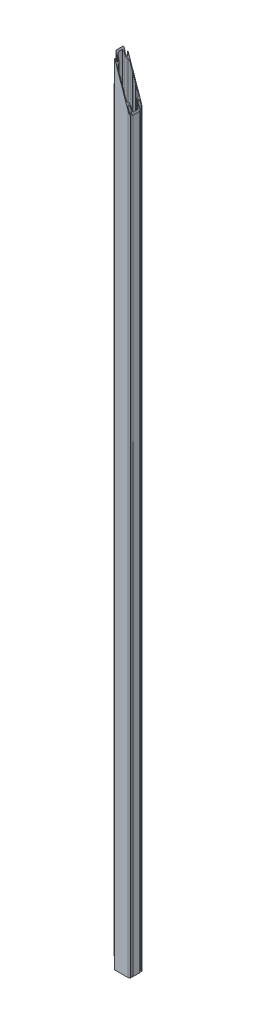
ISO-10303-21;
HEADER;
FILE_DESCRIPTION(('STEP AP214'),'2;1');
FILE_NAME('part.step','',(''),(''),'','','');
FILE_SCHEMA(('AUTOMOTIVE_DESIGN { 1 0 10303 214 1 1 1 1 }'));
ENDSEC;
DATA;
#1=APPLICATION_CONTEXT('core data for automotive mechanical design processes');
#2=APPLICATION_PROTOCOL_DEFINITION('international standard','automotive_design',2000,#1);
#3=PRODUCT_CONTEXT('',#1,'mechanical');
#4=PRODUCT('Part','Part','',(#3));
#5=PRODUCT_RELATED_PRODUCT_CATEGORY('part','',(#4));
#6=PRODUCT_DEFINITION_FORMATION('','',#4);
#7=PRODUCT_DEFINITION_CONTEXT('part definition',#1,'design');
#8=PRODUCT_DEFINITION('design','',#6,#7);
#9=PRODUCT_DEFINITION_SHAPE('','',#8);
#10=(LENGTH_UNIT() NAMED_UNIT(*) SI_UNIT(.MILLI.,.METRE.));
#11=(NAMED_UNIT(*) PLANE_ANGLE_UNIT() SI_UNIT($,.RADIAN.));
#12=(NAMED_UNIT(*) SI_UNIT($,.STERADIAN.) SOLID_ANGLE_UNIT());
#13=UNCERTAINTY_MEASURE_WITH_UNIT(LENGTH_MEASURE(1.E-05),#10,'distance_accuracy_value','');
#14=(GEOMETRIC_REPRESENTATION_CONTEXT(3) GLOBAL_UNCERTAINTY_ASSIGNED_CONTEXT((#13)) GLOBAL_UNIT_ASSIGNED_CONTEXT((#10,
#11,#12)) REPRESENTATION_CONTEXT('',''));
#15=CARTESIAN_POINT('',(0.,0.,0.));
#16=DIRECTION('',(0.,0.,1.));
#17=DIRECTION('',(1.,0.,0.));
#18=AXIS2_PLACEMENT_3D('',#15,#16,#17);
#19=CARTESIAN_POINT('',(-47.386410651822,4753.,44.3252148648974));
#20=DIRECTION('',(0.,-1.,0.));
#21=DIRECTION('',(0.,0.,-1.));
#22=AXIS2_PLACEMENT_3D('',#19,#20,#21);
#23=CYLINDRICAL_SURFACE('',#22,2.);
#24=CARTESIAN_POINT('',(-47.386410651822,4580.46091631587,44.3252148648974));
#25=DIRECTION('',(0.944834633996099,0.327547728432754,0.));
#26=DIRECTION('',(0.327547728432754,-0.944834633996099,0.));
#27=AXIS2_PLACEMENT_3D('',#24,#25,#26);
#28=ELLIPSE('',#27,6.10598036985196,2.);
#29=CARTESIAN_POINT('',(-45.5307846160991,4575.1082315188,43.5791237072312));
#30=VERTEX_POINT('',#29);
#31=CARTESIAN_POINT('',(-49.2420366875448,4585.81360111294,45.0713060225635));
#32=VERTEX_POINT('',#31);
#33=EDGE_CURVE('E536',#30,#32,#28,.T.);
#34=ORIENTED_EDGE('',*,*,#33,.F.);
#35=DIRECTION('',(0.,-1.,0.));
#36=VECTOR('',#35,1.);
#37=CARTESIAN_POINT('',(-45.5307846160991,4753.,43.5791237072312));
#38=LINE('',#37,#36);
#39=CARTESIAN_POINT('',(-45.5307846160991,70.0000000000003,43.5791237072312));
#40=VERTEX_POINT('',#39);
#41=EDGE_CURVE('E488',#30,#40,#38,.T.);
#42=ORIENTED_EDGE('',*,*,#41,.T.);
#43=CARTESIAN_POINT('',(-47.386410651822,70.0000000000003,44.3252148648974));
#44=DIRECTION('',(0.,-1.,0.));
#45=DIRECTION('',(0.,0.,-1.));
#46=AXIS2_PLACEMENT_3D('',#43,#44,#45);
#47=CIRCLE('',#46,2.);
#48=CARTESIAN_POINT('',(-49.2420366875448,70.0000000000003,45.0713060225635));
#49=VERTEX_POINT('',#48);
#50=EDGE_CURVE('E576',#49,#40,#47,.T.);
#51=ORIENTED_EDGE('',*,*,#50,.F.);
#52=DIRECTION('',(0.,-1.,0.));
#53=VECTOR('',#52,1.);
#54=CARTESIAN_POINT('',(-49.2420366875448,4753.,45.0713060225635));
#55=LINE('',#54,#53);
#56=EDGE_CURVE('E485',#32,#49,#55,.T.);
#57=ORIENTED_EDGE('',*,*,#56,.F.);
#58=EDGE_LOOP('',(#34,#42,#51,#57));
#59=FACE_BOUND('',#58,.T.);
#60=ADVANCED_FACE('F40',(#59),#23,.T.);
#61=CARTESIAN_POINT('',(-39.5,4753.,41.1543274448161));
#62=DIRECTION('',(0.,-1.,0.));
#63=DIRECTION('',(0.,0.,-1.));
#64=AXIS2_PLACEMENT_3D('',#61,#62,#63);
#65=CYLINDRICAL_SURFACE('',#64,10.5);
#66=CARTESIAN_POINT('',(-39.5,4557.71200592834,41.1543274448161));
#67=DIRECTION('',(0.944834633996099,0.327547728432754,0.));
#68=DIRECTION('',(0.327547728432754,-0.944834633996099,0.));
#69=AXIS2_PLACEMENT_3D('',#66,#67,#68);
#70=ELLIPSE('',#69,32.0563969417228,10.5);
#71=CARTESIAN_POINT('',(-39.5,4557.71200592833,51.6543274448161));
#72=VERTEX_POINT('',#71);
#73=EDGE_CURVE('E544',#32,#72,#70,.T.);
#74=ORIENTED_EDGE('',*,*,#73,.F.);
#75=ORIENTED_EDGE('',*,*,#56,.T.);
#76=CARTESIAN_POINT('',(-39.5,70.0000000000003,41.1543274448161));
#77=DIRECTION('',(0.,-1.,0.));
#78=DIRECTION('',(0.,0.,-1.));
#79=AXIS2_PLACEMENT_3D('',#76,#77,#78);
#80=CIRCLE('',#79,10.5);
#81=CARTESIAN_POINT('',(-39.5,70.,51.6543274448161));
#82=VERTEX_POINT('',#81);
#83=EDGE_CURVE('E514',#82,#49,#80,.T.);
#84=ORIENTED_EDGE('',*,*,#83,.F.);
#85=DIRECTION('',(0.,-1.,0.));
#86=VECTOR('',#85,1.);
#87=CARTESIAN_POINT('',(-39.5,4753.,51.6543274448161));
#88=LINE('',#87,#86);
#89=EDGE_CURVE('E480',#72,#82,#88,.T.);
#90=ORIENTED_EDGE('',*,*,#89,.F.);
#91=EDGE_LOOP('',(#74,#75,#84,#90));
#92=FACE_BOUND('',#91,.T.);
#93=ADVANCED_FACE('F1183',(#92),#65,.T.);
#94=CARTESIAN_POINT('',(-39.5,4753.,-17.8456725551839));
#95=DIRECTION('',(0.,-1.,0.));
#96=DIRECTION('',(0.,0.,-1.));
#97=AXIS2_PLACEMENT_3D('',#94,#95,#96);
#98=CYLINDRICAL_SURFACE('',#97,10.5);
#99=DIRECTION('',(0.,-1.,0.));
#100=VECTOR('',#99,1.);
#101=CARTESIAN_POINT('',(-49.2420366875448,4753.,-21.7626511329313));
#102=LINE('',#101,#100);
#103=CARTESIAN_POINT('',(-49.2420366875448,4585.81360111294,-21.7626511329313));
#104=VERTEX_POINT('',#103);
#105=CARTESIAN_POINT('',(-49.2420366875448,70.0000000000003,-21.7626511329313));
#106=VERTEX_POINT('',#105);
#107=EDGE_CURVE('E432',#104,#106,#102,.T.);
#108=ORIENTED_EDGE('',*,*,#107,.F.);
#109=CARTESIAN_POINT('',(-39.5,4557.71200592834,-17.8456725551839));
#110=DIRECTION('',(0.944834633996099,0.327547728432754,0.));
#111=DIRECTION('',(0.327547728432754,-0.944834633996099,0.));
#112=AXIS2_PLACEMENT_3D('',#109,#110,#111);
#113=ELLIPSE('',#112,32.0563969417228,10.5);
#114=CARTESIAN_POINT('',(-39.5,4557.71200592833,-28.3456725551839));
#115=VERTEX_POINT('',#114);
#116=EDGE_CURVE('E409',#104,#115,#113,.F.);
#117=ORIENTED_EDGE('',*,*,#116,.T.);
#118=DIRECTION('',(0.,-1.,0.));
#119=VECTOR('',#118,1.);
#120=CARTESIAN_POINT('',(-39.5,4753.,-28.3456725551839));
#121=LINE('',#120,#119);
#122=CARTESIAN_POINT('',(-39.5,70.,-28.3456725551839));
#123=VERTEX_POINT('',#122);
#124=EDGE_CURVE('E426',#115,#123,#121,.T.);
#125=ORIENTED_EDGE('',*,*,#124,.T.);
#126=CARTESIAN_POINT('',(-39.5,70.0000000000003,-17.8456725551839));
#127=DIRECTION('',(0.,1.,0.));
#128=DIRECTION('',(0.,0.,1.));
#129=AXIS2_PLACEMENT_3D('',#126,#127,#128);
#130=CIRCLE('',#129,10.5);
#131=EDGE_CURVE('E586',#106,#123,#130,.F.);
#132=ORIENTED_EDGE('',*,*,#131,.F.);
#133=EDGE_LOOP('',(#108,#117,#125,#132));
#134=FACE_BOUND('',#133,.T.);
#135=ADVANCED_FACE('F42',(#134),#98,.T.);
#136=CARTESIAN_POINT('',(-47.386410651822,4753.,-21.0165599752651));
#137=DIRECTION('',(0.,-1.,0.));
#138=DIRECTION('',(0.,0.,-1.));
#139=AXIS2_PLACEMENT_3D('',#136,#137,#138);
#140=CYLINDRICAL_SURFACE('',#139,2.);
#141=DIRECTION('',(0.,-1.,0.));
#142=VECTOR('',#141,1.);
#143=CARTESIAN_POINT('',(-45.5307846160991,4753.,-20.2704688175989));
#144=LINE('',#143,#142);
#145=CARTESIAN_POINT('',(-45.5307846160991,4575.1082315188,-20.2704688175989));
#146=VERTEX_POINT('',#145);
#147=CARTESIAN_POINT('',(-45.5307846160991,70.0000000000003,-20.2704688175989));
#148=VERTEX_POINT('',#147);
#149=EDGE_CURVE('E505',#146,#148,#144,.T.);
#150=ORIENTED_EDGE('',*,*,#149,.F.);
#151=CARTESIAN_POINT('',(-47.386410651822,4580.46091631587,-21.0165599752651));
#152=DIRECTION('',(0.944834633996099,0.327547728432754,0.));
#153=DIRECTION('',(0.327547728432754,-0.944834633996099,0.));
#154=AXIS2_PLACEMENT_3D('',#151,#152,#153);
#155=ELLIPSE('',#154,6.10598036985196,2.);
#156=EDGE_CURVE('E435',#146,#104,#155,.F.);
#157=ORIENTED_EDGE('',*,*,#156,.T.);
#158=ORIENTED_EDGE('',*,*,#107,.T.);
#159=CARTESIAN_POINT('',(-47.386410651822,70.0000000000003,-21.0165599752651));
#160=DIRECTION('',(0.,1.,0.));
#161=DIRECTION('',(0.,0.,1.));
#162=AXIS2_PLACEMENT_3D('',#159,#160,#161);
#163=CIRCLE('',#162,2.);
#164=EDGE_CURVE('E582',#148,#106,#163,.F.);
#165=ORIENTED_EDGE('',*,*,#164,.F.);
#166=EDGE_LOOP('',(#150,#157,#158,#165));
#167=FACE_BOUND('',#166,.T.);
#168=ADVANCED_FACE('F1211',(#167),#140,.T.);
#169=CARTESIAN_POINT('',(-39.5,4753.,-17.8456725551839));
#170=DIRECTION('',(0.,-1.,0.));
#171=DIRECTION('',(0.,0.,-1.));
#172=AXIS2_PLACEMENT_3D('',#169,#170,#171);
#173=CYLINDRICAL_SURFACE('',#172,10.5);
#174=CARTESIAN_POINT('',(-39.5,4722.71200592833,-17.8456725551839));
#175=DIRECTION('',(-0.944834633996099,-0.327547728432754,0.));
#176=DIRECTION('',(0.327547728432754,-0.944834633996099,0.));
#177=AXIS2_PLACEMENT_3D('',#174,#175,#176);
#178=ELLIPSE('',#177,32.0563969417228,10.5);
#179=CARTESIAN_POINT('',(-39.5,4722.71200592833,-7.34567255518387));
#180=VERTEX_POINT('',#179);
#181=CARTESIAN_POINT('',(-29.,4692.42401185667,-17.8456725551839));
#182=VERTEX_POINT('',#181);
#183=EDGE_CURVE('E706',#180,#182,#178,.F.);
#184=ORIENTED_EDGE('',*,*,#183,.F.);
#185=DIRECTION('',(0.,-1.,0.));
#186=VECTOR('',#185,1.);
#187=CARTESIAN_POINT('',(-39.5,4753.,-7.34567255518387));
#188=LINE('',#187,#186);
#189=CARTESIAN_POINT('',(-39.5,0.,-7.34567255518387));
#190=VERTEX_POINT('',#189);
#191=EDGE_CURVE('E510',#180,#190,#188,.T.);
#192=ORIENTED_EDGE('',*,*,#191,.T.);
#193=CARTESIAN_POINT('',(-39.5,0.,-17.8456725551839));
#194=DIRECTION('',(0.,1.,0.));
#195=DIRECTION('',(0.,0.,1.));
#196=AXIS2_PLACEMENT_3D('',#193,#194,#195);
#197=CIRCLE('',#196,10.5);
#198=CARTESIAN_POINT('',(-29.,0.,-17.8456725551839));
#199=VERTEX_POINT('',#198);
#200=EDGE_CURVE('E813',#199,#190,#197,.F.);
#201=ORIENTED_EDGE('',*,*,#200,.F.);
#202=DIRECTION('',(0.,-1.,0.));
#203=VECTOR('',#202,1.);
#204=CARTESIAN_POINT('',(-29.,4753.,-17.8456725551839));
#205=LINE('',#204,#203);
#206=EDGE_CURVE('E449',#182,#199,#205,.T.);
#207=ORIENTED_EDGE('',*,*,#206,.F.);
#208=EDGE_LOOP('',(#184,#192,#201,#207));
#209=FACE_BOUND('',#208,.T.);
#210=ADVANCED_FACE('F1044',(#209),#173,.T.);
#211=CARTESIAN_POINT('',(-22.5,4753.,-17.8456725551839));
#212=DIRECTION('',(0.,-1.,0.));
#213=DIRECTION('',(0.,0.,-1.));
#214=AXIS2_PLACEMENT_3D('',#211,#212,#213);
#215=CYLINDRICAL_SURFACE('',#214,6.49999999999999);
#216=DIRECTION('',(0.,-1.,0.));
#217=VECTOR('',#216,1.);
#218=CARTESIAN_POINT('',(-22.5,4753.,-24.3456725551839));
#219=LINE('',#218,#217);
#220=CARTESIAN_POINT('',(-22.5,4673.67430124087,-24.3456725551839));
#221=VERTEX_POINT('',#220);
#222=CARTESIAN_POINT('',(-22.5,0.,-24.3456725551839));
#223=VERTEX_POINT('',#222);
#224=EDGE_CURVE('E1028',#221,#223,#219,.T.);
#225=ORIENTED_EDGE('',*,*,#224,.F.);
#226=CARTESIAN_POINT('',(-22.5,4673.67430124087,-17.8456725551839));
#227=DIRECTION('',(-0.944834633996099,-0.327547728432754,0.));
#228=DIRECTION('',(0.327547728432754,-0.944834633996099,0.));
#229=AXIS2_PLACEMENT_3D('',#226,#227,#228);
#230=ELLIPSE('',#229,19.8444362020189,6.49999999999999);
#231=EDGE_CURVE('E702',#221,#182,#230,.F.);
#232=ORIENTED_EDGE('',*,*,#231,.T.);
#233=ORIENTED_EDGE('',*,*,#206,.T.);
#234=CARTESIAN_POINT('',(-22.5,0.,-17.8456725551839));
#235=DIRECTION('',(0.,1.,0.));
#236=DIRECTION('',(0.,0.,1.));
#237=AXIS2_PLACEMENT_3D('',#234,#235,#236);
#238=CIRCLE('',#237,6.49999999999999);
#239=EDGE_CURVE('E817',#199,#223,#238,.F.);
#240=ORIENTED_EDGE('',*,*,#239,.T.);
#241=EDGE_LOOP('',(#225,#232,#233,#240));
#242=FACE_BOUND('',#241,.T.);
#243=ADVANCED_FACE('F1037',(#242),#215,.F.);
#244=CARTESIAN_POINT('',(0.,4753.,-24.3456725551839));
#245=DIRECTION('',(0.,0.,-1.));
#246=DIRECTION('',(-1.,0.,0.));
#247=AXIS2_PLACEMENT_3D('',#244,#245,#246);
#248=PLANE('',#247);
#249=DIRECTION('',(0.,-1.,0.));
#250=VECTOR('',#249,1.);
#251=CARTESIAN_POINT('',(-12.5,4753.,-24.3456725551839));
#252=LINE('',#251,#250);
#253=CARTESIAN_POINT('',(-12.5,4644.82859260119,-24.3456725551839));
#254=VERTEX_POINT('',#253);
#255=CARTESIAN_POINT('',(-12.5,0.,-24.3456725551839));
#256=VERTEX_POINT('',#255);
#257=EDGE_CURVE('E1026',#254,#256,#252,.T.);
#258=ORIENTED_EDGE('',*,*,#257,.F.);
#259=DIRECTION('',(-0.327547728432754,0.944834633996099,0.));
#260=VECTOR('',#259,1.);
#261=CARTESIAN_POINT('',(-44.6356242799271,4737.5260780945,-24.3456725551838));
#262=LINE('',#261,#260);
#263=EDGE_CURVE('E698',#254,#221,#262,.T.);
#264=ORIENTED_EDGE('',*,*,#263,.T.);
#265=ORIENTED_EDGE('',*,*,#224,.T.);
#266=DIRECTION('',(1.,0.,0.));
#267=VECTOR('',#266,1.);
#268=CARTESIAN_POINT('',(0.,0.,-24.3456725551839));
#269=LINE('',#268,#267);
#270=EDGE_CURVE('E821',#223,#256,#269,.T.);
#271=ORIENTED_EDGE('',*,*,#270,.T.);
#272=EDGE_LOOP('',(#258,#264,#265,#271));
#273=FACE_BOUND('',#272,.T.);
#274=ADVANCED_FACE('F1173',(#273),#248,.F.);
#275=CARTESIAN_POINT('',(5.92283627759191,4753.,-5.9228362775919));
#276=DIRECTION('',(-0.707106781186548,0.,0.707106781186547));
#277=DIRECTION('',(0.707106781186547,0.,0.707106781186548));
#278=AXIS2_PLACEMENT_3D('',#275,#276,#277);
#279=PLANE('',#278);
#280=DIRECTION('',(0.311275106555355,-0.897895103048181,0.311275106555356));
#281=VECTOR('',#280,1.);
#282=CARTESIAN_POINT('',(-39.1630276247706,4721.73998523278,-51.0087001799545));
#283=LINE('',#282,#281);
#284=CARTESIAN_POINT('',(-11.,4640.50173630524,-22.8456725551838));
#285=VERTEX_POINT('',#284);
#286=EDGE_CURVE('E695',#254,#285,#283,.T.);
#287=ORIENTED_EDGE('',*,*,#286,.F.);
#288=ORIENTED_EDGE('',*,*,#257,.T.);
#289=DIRECTION('',(-0.707106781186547,0.,-0.707106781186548));
#290=VECTOR('',#289,1.);
#291=CARTESIAN_POINT('',(5.92283627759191,0.,-5.9228362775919));
#292=LINE('',#291,#290);
#293=CARTESIAN_POINT('',(-11.,0.,-22.8456725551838));
#294=VERTEX_POINT('',#293);
#295=EDGE_CURVE('E825',#294,#256,#292,.T.);
#296=ORIENTED_EDGE('',*,*,#295,.F.);
#297=DIRECTION('',(0.,-1.,0.));
#298=VECTOR('',#297,1.);
#299=CARTESIAN_POINT('',(-11.,4753.,-22.8456725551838));
#300=LINE('',#299,#298);
#301=EDGE_CURVE('E1023',#285,#294,#300,.T.);
#302=ORIENTED_EDGE('',*,*,#301,.F.);
#303=EDGE_LOOP('',(#287,#288,#296,#302));
#304=FACE_BOUND('',#303,.T.);
#305=ADVANCED_FACE('F1171',(#304),#279,.T.);
#306=CARTESIAN_POINT('',(0.,4753.,-22.8456725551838));
#307=DIRECTION('',(0.,0.,-1.));
#308=DIRECTION('',(-1.,0.,0.));
#309=AXIS2_PLACEMENT_3D('',#306,#307,#308);
#310=PLANE('',#309);
#311=DIRECTION('',(0.,-1.,0.));
#312=VECTOR('',#311,1.);
#313=CARTESIAN_POINT('',(-8.,4753.,-22.8456725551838));
#314=LINE('',#313,#312);
#315=CARTESIAN_POINT('',(-7.99999999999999,4631.84802371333,-22.8456725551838));
#316=VERTEX_POINT('',#315);
#317=CARTESIAN_POINT('',(-8.,0.,-22.8456725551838));
#318=VERTEX_POINT('',#317);
#319=EDGE_CURVE('E1020',#316,#318,#314,.T.);
#320=ORIENTED_EDGE('',*,*,#319,.F.);
#321=DIRECTION('',(-0.327547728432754,0.944834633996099,0.));
#322=VECTOR('',#321,1.);
#323=CARTESIAN_POINT('',(-44.6356242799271,4737.5260780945,-22.8456725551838));
#324=LINE('',#323,#322);
#325=EDGE_CURVE('E691',#316,#285,#324,.T.);
#326=ORIENTED_EDGE('',*,*,#325,.T.);
#327=ORIENTED_EDGE('',*,*,#301,.T.);
#328=DIRECTION('',(1.,0.,0.));
#329=VECTOR('',#328,1.);
#330=CARTESIAN_POINT('',(0.,0.,-22.8456725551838));
#331=LINE('',#330,#329);
#332=EDGE_CURVE('E829',#294,#318,#331,.T.);
#333=ORIENTED_EDGE('',*,*,#332,.T.);
#334=EDGE_LOOP('',(#320,#326,#327,#333));
#335=FACE_BOUND('',#334,.T.);
#336=ADVANCED_FACE('F1166',(#335),#310,.F.);
#337=CARTESIAN_POINT('',(-15.4228362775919,4753.,-15.422836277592));
#338=DIRECTION('',(-0.707106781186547,0.,-0.707106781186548));
#339=DIRECTION('',(-0.707106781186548,0.,0.707106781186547));
#340=AXIS2_PLACEMENT_3D('',#337,#338,#339);
#341=PLANE('',#340);
#342=DIRECTION('',(0.,-1.,0.));
#343=VECTOR('',#342,1.);
#344=CARTESIAN_POINT('',(-6.50000000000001,4753.,-24.3456725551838));
#345=LINE('',#344,#343);
#346=CARTESIAN_POINT('',(-6.50000000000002,4627.52116741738,-24.3456725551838));
#347=VERTEX_POINT('',#346);
#348=CARTESIAN_POINT('',(-6.50000000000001,0.,-24.3456725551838));
#349=VERTEX_POINT('',#348);
#350=EDGE_CURVE('E1017',#347,#349,#345,.T.);
#351=ORIENTED_EDGE('',*,*,#350,.F.);
#352=DIRECTION('',(-0.311275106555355,0.897895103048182,0.311275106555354));
#353=VECTOR('',#352,1.);
#354=CARTESIAN_POINT('',(-43.2994856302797,4733.6718914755,12.4538130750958));
#355=LINE('',#354,#353);
#356=EDGE_CURVE('E687',#347,#316,#355,.T.);
#357=ORIENTED_EDGE('',*,*,#356,.T.);
#358=ORIENTED_EDGE('',*,*,#319,.T.);
#359=DIRECTION('',(0.707106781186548,0.,-0.707106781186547));
#360=VECTOR('',#359,1.);
#361=CARTESIAN_POINT('',(-15.4228362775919,0.,-15.422836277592));
#362=LINE('',#361,#360);
#363=EDGE_CURVE('E833',#318,#349,#362,.T.);
#364=ORIENTED_EDGE('',*,*,#363,.T.);
#365=EDGE_LOOP('',(#351,#357,#358,#364));
#366=FACE_BOUND('',#365,.T.);
#367=ADVANCED_FACE('F1163',(#366),#341,.F.);
#368=CARTESIAN_POINT('',(0.,4753.,-24.3456725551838));
#369=DIRECTION('',(0.,0.,1.));
#370=DIRECTION('',(1.,0.,0.));
#371=AXIS2_PLACEMENT_3D('',#368,#369,#370);
#372=PLANE('',#371);
#373=DIRECTION('',(0.327547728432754,-0.944834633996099,0.));
#374=VECTOR('',#373,1.);
#375=CARTESIAN_POINT('',(-44.6356242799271,4737.5260780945,-24.3456725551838));
#376=LINE('',#375,#374);
#377=CARTESIAN_POINT('',(6.50000000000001,4590.02174618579,-24.3456725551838));
#378=VERTEX_POINT('',#377);
#379=EDGE_CURVE('E684',#347,#378,#376,.T.);
#380=ORIENTED_EDGE('',*,*,#379,.F.);
#381=ORIENTED_EDGE('',*,*,#350,.T.);
#382=DIRECTION('',(-1.,0.,0.));
#383=VECTOR('',#382,1.);
#384=CARTESIAN_POINT('',(0.,0.,-24.3456725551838));
#385=LINE('',#384,#383);
#386=CARTESIAN_POINT('',(6.50000000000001,0.,-24.3456725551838));
#387=VERTEX_POINT('',#386);
#388=EDGE_CURVE('E837',#387,#349,#385,.T.);
#389=ORIENTED_EDGE('',*,*,#388,.F.);
#390=DIRECTION('',(0.,-1.,0.));
#391=VECTOR('',#390,1.);
#392=CARTESIAN_POINT('',(6.50000000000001,4753.,-24.3456725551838));
#393=LINE('',#392,#391);
#394=EDGE_CURVE('E1014',#378,#387,#393,.T.);
#395=ORIENTED_EDGE('',*,*,#394,.F.);
#396=EDGE_LOOP('',(#380,#381,#389,#395));
#397=FACE_BOUND('',#396,.T.);
#398=ADVANCED_FACE('F1160',(#397),#372,.T.);
#399=CARTESIAN_POINT('',(15.4228362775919,4753.,-15.422836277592));
#400=DIRECTION('',(-0.707106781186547,0.,0.707106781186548));
#401=DIRECTION('',(0.707106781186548,0.,0.707106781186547));
#402=AXIS2_PLACEMENT_3D('',#399,#400,#401);
#403=PLANE('',#402);
#404=DIRECTION('',(0.311275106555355,-0.897895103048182,0.311275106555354));
#405=VECTOR('',#404,1.);
#406=CARTESIAN_POINT('',(-37.3220759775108,4716.42962974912,-68.1677485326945));
#407=LINE('',#406,#405);
#408=CARTESIAN_POINT('',(8.00000000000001,4585.69488988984,-22.8456725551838));
#409=VERTEX_POINT('',#408);
#410=EDGE_CURVE('E681',#378,#409,#407,.T.);
#411=ORIENTED_EDGE('',*,*,#410,.F.);
#412=ORIENTED_EDGE('',*,*,#394,.T.);
#413=DIRECTION('',(-0.707106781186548,0.,-0.707106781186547));
#414=VECTOR('',#413,1.);
#415=CARTESIAN_POINT('',(15.4228362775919,0.,-15.422836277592));
#416=LINE('',#415,#414);
#417=CARTESIAN_POINT('',(8.,0.,-22.8456725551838));
#418=VERTEX_POINT('',#417);
#419=EDGE_CURVE('E841',#418,#387,#416,.T.);
#420=ORIENTED_EDGE('',*,*,#419,.F.);
#421=DIRECTION('',(0.,-1.,0.));
#422=VECTOR('',#421,1.);
#423=CARTESIAN_POINT('',(8.,4753.,-22.8456725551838));
#424=LINE('',#423,#422);
#425=EDGE_CURVE('E1011',#409,#418,#424,.T.);
#426=ORIENTED_EDGE('',*,*,#425,.F.);
#427=EDGE_LOOP('',(#411,#412,#420,#426));
#428=FACE_BOUND('',#427,.T.);
#429=ADVANCED_FACE('F1153',(#428),#403,.T.);
#430=CARTESIAN_POINT('',(0.,4753.,-22.8456725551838));
#431=DIRECTION('',(0.,0.,1.));
#432=DIRECTION('',(1.,0.,0.));
#433=AXIS2_PLACEMENT_3D('',#430,#431,#432);
#434=PLANE('',#433);
#435=DIRECTION('',(0.327547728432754,-0.944834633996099,0.));
#436=VECTOR('',#435,1.);
#437=CARTESIAN_POINT('',(-44.6356242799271,4737.5260780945,-22.8456725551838));
#438=LINE('',#437,#436);
#439=CARTESIAN_POINT('',(11.,4577.04117729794,-22.8456725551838));
#440=VERTEX_POINT('',#439);
#441=EDGE_CURVE('E678',#409,#440,#438,.T.);
#442=ORIENTED_EDGE('',*,*,#441,.F.);
#443=ORIENTED_EDGE('',*,*,#425,.T.);
#444=DIRECTION('',(-1.,0.,0.));
#445=VECTOR('',#444,1.);
#446=CARTESIAN_POINT('',(0.,0.,-22.8456725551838));
#447=LINE('',#446,#445);
#448=CARTESIAN_POINT('',(11.,0.,-22.8456725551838));
#449=VERTEX_POINT('',#448);
#450=EDGE_CURVE('E845',#449,#418,#447,.T.);
#451=ORIENTED_EDGE('',*,*,#450,.F.);
#452=DIRECTION('',(0.,-1.,0.));
#453=VECTOR('',#452,1.);
#454=CARTESIAN_POINT('',(11.,4753.,-22.8456725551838));
#455=LINE('',#454,#453);
#456=EDGE_CURVE('E1008',#440,#449,#455,.T.);
#457=ORIENTED_EDGE('',*,*,#456,.F.);
#458=EDGE_LOOP('',(#442,#443,#451,#457));
#459=FACE_BOUND('',#458,.T.);
#460=ADVANCED_FACE('F1148',(#459),#434,.T.);
#461=CARTESIAN_POINT('',(-5.92283627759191,4753.,-5.9228362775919));
#462=DIRECTION('',(-0.707106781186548,0.,-0.707106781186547));
#463=DIRECTION('',(-0.707106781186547,0.,0.707106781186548));
#464=AXIS2_PLACEMENT_3D('',#461,#462,#463);
#465=PLANE('',#464);
#466=DIRECTION('',(0.,-1.,0.));
#467=VECTOR('',#466,1.);
#468=CARTESIAN_POINT('',(12.5,4753.,-24.3456725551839));
#469=LINE('',#468,#467);
#470=CARTESIAN_POINT('',(12.5,4572.71432100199,-24.3456725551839));
#471=VERTEX_POINT('',#470);
#472=CARTESIAN_POINT('',(12.5,0.,-24.3456725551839));
#473=VERTEX_POINT('',#472);
#474=EDGE_CURVE('E1005',#471,#473,#469,.T.);
#475=ORIENTED_EDGE('',*,*,#474,.F.);
#476=DIRECTION('',(-0.311275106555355,0.897895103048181,0.311275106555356));
#477=VECTOR('',#476,1.);
#478=CARTESIAN_POINT('',(-41.4585339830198,4728.36153599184,29.6128614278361));
#479=LINE('',#478,#477);
#480=EDGE_CURVE('E674',#471,#440,#479,.T.);
#481=ORIENTED_EDGE('',*,*,#480,.T.);
#482=ORIENTED_EDGE('',*,*,#456,.T.);
#483=DIRECTION('',(0.707106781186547,0.,-0.707106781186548));
#484=VECTOR('',#483,1.);
#485=CARTESIAN_POINT('',(-5.92283627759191,0.,-5.9228362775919));
#486=LINE('',#485,#484);
#487=EDGE_CURVE('E849',#449,#473,#486,.T.);
#488=ORIENTED_EDGE('',*,*,#487,.T.);
#489=EDGE_LOOP('',(#475,#481,#482,#488));
#490=FACE_BOUND('',#489,.T.);
#491=ADVANCED_FACE('F1368',(#490),#465,.F.);
#492=CARTESIAN_POINT('',(0.,4753.,-24.3456725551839));
#493=DIRECTION('',(0.,0.,1.));
#494=DIRECTION('',(1.,0.,0.));
#495=AXIS2_PLACEMENT_3D('',#492,#493,#494);
#496=PLANE('',#495);
#497=DIRECTION('',(0.327547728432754,-0.944834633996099,0.));
#498=VECTOR('',#497,1.);
#499=CARTESIAN_POINT('',(-44.6356242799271,4737.5260780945,-24.3456725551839));
#500=LINE('',#499,#498);
#501=CARTESIAN_POINT('',(22.5,4543.8686123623,-24.3456725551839));
#502=VERTEX_POINT('',#501);
#503=EDGE_CURVE('E671',#471,#502,#500,.T.);
#504=ORIENTED_EDGE('',*,*,#503,.F.);
#505=ORIENTED_EDGE('',*,*,#474,.T.);
#506=DIRECTION('',(-1.,0.,0.));
#507=VECTOR('',#506,1.);
#508=CARTESIAN_POINT('',(0.,0.,-24.3456725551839));
#509=LINE('',#508,#507);
#510=CARTESIAN_POINT('',(22.5,0.,-24.3456725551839));
#511=VERTEX_POINT('',#510);
#512=EDGE_CURVE('E853',#511,#473,#509,.T.);
#513=ORIENTED_EDGE('',*,*,#512,.F.);
#514=DIRECTION('',(0.,-1.,0.));
#515=VECTOR('',#514,1.);
#516=CARTESIAN_POINT('',(22.5,4753.,-24.3456725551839));
#517=LINE('',#516,#515);
#518=EDGE_CURVE('E1002',#502,#511,#517,.T.);
#519=ORIENTED_EDGE('',*,*,#518,.F.);
#520=EDGE_LOOP('',(#504,#505,#513,#519));
#521=FACE_BOUND('',#520,.T.);
#522=ADVANCED_FACE('F1140',(#521),#496,.T.);
#523=CARTESIAN_POINT('',(22.5,4753.,-17.8456725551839));
#524=DIRECTION('',(0.,-1.,0.));
#525=DIRECTION('',(0.,0.,-1.));
#526=AXIS2_PLACEMENT_3D('',#523,#524,#525);
#527=CYLINDRICAL_SURFACE('',#526,6.49999999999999);
#528=CARTESIAN_POINT('',(22.5,4543.8686123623,-17.8456725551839));
#529=DIRECTION('',(-0.944834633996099,-0.327547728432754,0.));
#530=DIRECTION('',(0.327547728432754,-0.944834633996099,0.));
#531=AXIS2_PLACEMENT_3D('',#528,#529,#530);
#532=ELLIPSE('',#531,19.8444362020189,6.49999999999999);
#533=CARTESIAN_POINT('',(29.,4525.11890174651,-17.8456725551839));
#534=VERTEX_POINT('',#533);
#535=EDGE_CURVE('E668',#502,#534,#532,.T.);
#536=ORIENTED_EDGE('',*,*,#535,.F.);
#537=ORIENTED_EDGE('',*,*,#518,.T.);
#538=CARTESIAN_POINT('',(22.5,0.,-17.8456725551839));
#539=DIRECTION('',(0.,1.,0.));
#540=DIRECTION('',(0.,0.,1.));
#541=AXIS2_PLACEMENT_3D('',#538,#539,#540);
#542=CIRCLE('',#541,6.49999999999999);
#543=CARTESIAN_POINT('',(29.,0.,-17.8456725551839));
#544=VERTEX_POINT('',#543);
#545=EDGE_CURVE('E857',#544,#511,#542,.T.);
#546=ORIENTED_EDGE('',*,*,#545,.F.);
#547=DIRECTION('',(0.,-1.,0.));
#548=VECTOR('',#547,1.);
#549=CARTESIAN_POINT('',(29.,4753.,-17.8456725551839));
#550=LINE('',#549,#548);
#551=EDGE_CURVE('E999',#534,#544,#550,.T.);
#552=ORIENTED_EDGE('',*,*,#551,.F.);
#553=EDGE_LOOP('',(#536,#537,#546,#552));
#554=FACE_BOUND('',#553,.T.);
#555=ADVANCED_FACE('F1135',(#554),#527,.F.);
#556=CARTESIAN_POINT('',(39.5,4753.,-17.8456725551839));
#557=DIRECTION('',(0.,-1.,0.));
#558=DIRECTION('',(0.,0.,-1.));
#559=AXIS2_PLACEMENT_3D('',#556,#557,#558);
#560=CYLINDRICAL_SURFACE('',#559,10.5);
#561=DIRECTION('',(0.,-1.,0.));
#562=VECTOR('',#561,1.);
#563=CARTESIAN_POINT('',(39.5,4753.,-7.34567255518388));
#564=LINE('',#563,#562);
#565=CARTESIAN_POINT('',(39.5,4494.83090767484,-7.34567255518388));
#566=VERTEX_POINT('',#565);
#567=CARTESIAN_POINT('',(39.5,0.,-7.34567255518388));
#568=VERTEX_POINT('',#567);
#569=EDGE_CURVE('E996',#566,#568,#564,.T.);
#570=ORIENTED_EDGE('',*,*,#569,.F.);
#571=CARTESIAN_POINT('',(39.5,4494.83090767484,-17.8456725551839));
#572=DIRECTION('',(-0.944834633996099,-0.327547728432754,0.));
#573=DIRECTION('',(0.327547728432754,-0.944834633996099,0.));
#574=AXIS2_PLACEMENT_3D('',#571,#572,#573);
#575=ELLIPSE('',#574,32.0563969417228,10.5);
#576=EDGE_CURVE('E664',#566,#534,#575,.T.);
#577=ORIENTED_EDGE('',*,*,#576,.T.);
#578=ORIENTED_EDGE('',*,*,#551,.T.);
#579=CARTESIAN_POINT('',(39.5,0.,-17.8456725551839));
#580=DIRECTION('',(0.,1.,0.));
#581=DIRECTION('',(0.,0.,1.));
#582=AXIS2_PLACEMENT_3D('',#579,#580,#581);
#583=CIRCLE('',#582,10.5);
#584=EDGE_CURVE('E861',#544,#568,#583,.T.);
#585=ORIENTED_EDGE('',*,*,#584,.T.);
#586=EDGE_LOOP('',(#570,#577,#578,#585));
#587=FACE_BOUND('',#586,.T.);
#588=ADVANCED_FACE('F1361',(#587),#560,.T.);
#589=CARTESIAN_POINT('',(39.5,4753.,-0.845672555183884));
#590=DIRECTION('',(0.,-1.,0.));
#591=DIRECTION('',(0.,0.,-1.));
#592=AXIS2_PLACEMENT_3D('',#589,#590,#591);
#593=CYLINDRICAL_SURFACE('',#592,6.49999999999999);
#594=CARTESIAN_POINT('',(39.5,4494.83090767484,-0.845672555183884));
#595=DIRECTION('',(-0.944834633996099,-0.327547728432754,0.));
#596=DIRECTION('',(0.327547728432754,-0.944834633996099,0.));
#597=AXIS2_PLACEMENT_3D('',#594,#595,#596);
#598=ELLIPSE('',#597,19.8444362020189,6.49999999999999);
#599=CARTESIAN_POINT('',(46.,4476.08119705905,-0.845672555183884));
#600=VERTEX_POINT('',#599);
#601=EDGE_CURVE('E661',#566,#600,#598,.T.);
#602=ORIENTED_EDGE('',*,*,#601,.F.);
#603=ORIENTED_EDGE('',*,*,#569,.T.);
#604=CARTESIAN_POINT('',(39.5,0.,-0.845672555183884));
#605=DIRECTION('',(0.,1.,0.));
#606=DIRECTION('',(0.,0.,1.));
#607=AXIS2_PLACEMENT_3D('',#604,#605,#606);
#608=CIRCLE('',#607,6.49999999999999);
#609=CARTESIAN_POINT('',(46.,0.,-0.845672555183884));
#610=VERTEX_POINT('',#609);
#611=EDGE_CURVE('E865',#610,#568,#608,.T.);
#612=ORIENTED_EDGE('',*,*,#611,.F.);
#613=DIRECTION('',(0.,-1.,0.));
#614=VECTOR('',#613,1.);
#615=CARTESIAN_POINT('',(46.,4753.,-0.845672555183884));
#616=LINE('',#615,#614);
#617=EDGE_CURVE('E993',#600,#610,#616,.T.);
#618=ORIENTED_EDGE('',*,*,#617,.F.);
#619=EDGE_LOOP('',(#602,#603,#612,#618));
#620=FACE_BOUND('',#619,.T.);
#621=ADVANCED_FACE('F1127',(#620),#593,.F.);
#622=CARTESIAN_POINT('',(46.,4753.,0.));
#623=DIRECTION('',(-1.,0.,0.));
#624=DIRECTION('',(0.,0.,1.));
#625=AXIS2_PLACEMENT_3D('',#622,#623,#624);
#626=PLANE('',#625);
#627=DIRECTION('',(0.,0.,1.));
#628=VECTOR('',#627,1.);
#629=CARTESIAN_POINT('',(46.,4476.08119705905,0.));
#630=LINE('',#629,#628);
#631=CARTESIAN_POINT('',(46.,4476.08119705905,24.1543274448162));
#632=VERTEX_POINT('',#631);
#633=EDGE_CURVE('E658',#600,#632,#630,.T.);
#634=ORIENTED_EDGE('',*,*,#633,.F.);
#635=ORIENTED_EDGE('',*,*,#617,.T.);
#636=DIRECTION('',(0.,0.,-1.));
#637=VECTOR('',#636,1.);
#638=CARTESIAN_POINT('',(46.,0.,0.));
#639=LINE('',#638,#637);
#640=CARTESIAN_POINT('',(46.,0.,24.1543274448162));
#641=VERTEX_POINT('',#640);
#642=EDGE_CURVE('E869',#641,#610,#639,.T.);
#643=ORIENTED_EDGE('',*,*,#642,.F.);
#644=DIRECTION('',(0.,-1.,0.));
#645=VECTOR('',#644,1.);
#646=CARTESIAN_POINT('',(46.,4753.,24.1543274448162));
#647=LINE('',#646,#645);
#648=EDGE_CURVE('E990',#632,#641,#647,.T.);
#649=ORIENTED_EDGE('',*,*,#648,.F.);
#650=EDGE_LOOP('',(#634,#635,#643,#649));
#651=FACE_BOUND('',#650,.T.);
#652=ADVANCED_FACE('F1122',(#651),#626,.T.);
#653=CARTESIAN_POINT('',(39.5,4753.,24.1543274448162));
#654=DIRECTION('',(0.,-1.,0.));
#655=DIRECTION('',(0.,0.,-1.));
#656=AXIS2_PLACEMENT_3D('',#653,#654,#655);
#657=CYLINDRICAL_SURFACE('',#656,6.49999999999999);
#658=DIRECTION('',(0.,-1.,0.));
#659=VECTOR('',#658,1.);
#660=CARTESIAN_POINT('',(39.5,4753.,30.6543274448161));
#661=LINE('',#660,#659);
#662=CARTESIAN_POINT('',(39.5,4494.83090767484,30.6543274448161));
#663=VERTEX_POINT('',#662);
#664=CARTESIAN_POINT('',(39.5,0.,30.6543274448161));
#665=VERTEX_POINT('',#664);
#666=EDGE_CURVE('E987',#663,#665,#661,.T.);
#667=ORIENTED_EDGE('',*,*,#666,.F.);
#668=CARTESIAN_POINT('',(39.5,4494.83090767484,24.1543274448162));
#669=DIRECTION('',(-0.944834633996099,-0.327547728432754,0.));
#670=DIRECTION('',(0.327547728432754,-0.944834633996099,0.));
#671=AXIS2_PLACEMENT_3D('',#668,#669,#670);
#672=ELLIPSE('',#671,19.8444362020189,6.49999999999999);
#673=EDGE_CURVE('E654',#663,#632,#672,.F.);
#674=ORIENTED_EDGE('',*,*,#673,.T.);
#675=ORIENTED_EDGE('',*,*,#648,.T.);
#676=CARTESIAN_POINT('',(39.5,0.,24.1543274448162));
#677=DIRECTION('',(0.,1.,0.));
#678=DIRECTION('',(0.,0.,1.));
#679=AXIS2_PLACEMENT_3D('',#676,#677,#678);
#680=CIRCLE('',#679,6.49999999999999);
#681=EDGE_CURVE('E873',#641,#665,#680,.F.);
#682=ORIENTED_EDGE('',*,*,#681,.T.);
#683=EDGE_LOOP('',(#667,#674,#675,#682));
#684=FACE_BOUND('',#683,.T.);
#685=ADVANCED_FACE('F1117',(#684),#657,.F.);
#686=CARTESIAN_POINT('',(39.5,4753.,41.1543274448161));
#687=DIRECTION('',(0.,-1.,0.));
#688=DIRECTION('',(0.,0.,-1.));
#689=AXIS2_PLACEMENT_3D('',#686,#687,#688);
#690=CYLINDRICAL_SURFACE('',#689,10.5);
#691=CARTESIAN_POINT('',(39.5,4494.83090767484,41.1543274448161));
#692=DIRECTION('',(-0.944834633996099,-0.327547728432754,0.));
#693=DIRECTION('',(0.327547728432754,-0.944834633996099,0.));
#694=AXIS2_PLACEMENT_3D('',#691,#692,#693);
#695=ELLIPSE('',#694,32.0563969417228,10.5);
#696=CARTESIAN_POINT('',(29.,4525.11890174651,41.1543274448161));
#697=VERTEX_POINT('',#696);
#698=EDGE_CURVE('E651',#663,#697,#695,.F.);
#699=ORIENTED_EDGE('',*,*,#698,.F.);
#700=ORIENTED_EDGE('',*,*,#666,.T.);
#701=CARTESIAN_POINT('',(39.5,0.,41.1543274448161));
#702=DIRECTION('',(0.,1.,0.));
#703=DIRECTION('',(0.,0.,1.));
#704=AXIS2_PLACEMENT_3D('',#701,#702,#703);
#705=CIRCLE('',#704,10.5);
#706=CARTESIAN_POINT('',(29.,0.,41.1543274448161));
#707=VERTEX_POINT('',#706);
#708=EDGE_CURVE('E877',#707,#665,#705,.F.);
#709=ORIENTED_EDGE('',*,*,#708,.F.);
#710=DIRECTION('',(0.,-1.,0.));
#711=VECTOR('',#710,1.);
#712=CARTESIAN_POINT('',(29.,4753.,41.1543274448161));
#713=LINE('',#712,#711);
#714=EDGE_CURVE('E984',#697,#707,#713,.T.);
#715=ORIENTED_EDGE('',*,*,#714,.F.);
#716=EDGE_LOOP('',(#699,#700,#709,#715));
#717=FACE_BOUND('',#716,.T.);
#718=ADVANCED_FACE('F1114',(#717),#690,.T.);
#719=CARTESIAN_POINT('',(22.5,4753.,41.1543274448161));
#720=DIRECTION('',(0.,-1.,0.));
#721=DIRECTION('',(0.,0.,-1.));
#722=AXIS2_PLACEMENT_3D('',#719,#720,#721);
#723=CYLINDRICAL_SURFACE('',#722,6.5);
#724=DIRECTION('',(0.,-1.,0.));
#725=VECTOR('',#724,1.);
#726=CARTESIAN_POINT('',(22.5,4753.,47.6543274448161));
#727=LINE('',#726,#725);
#728=CARTESIAN_POINT('',(22.5,4543.8686123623,47.6543274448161));
#729=VERTEX_POINT('',#728);
#730=CARTESIAN_POINT('',(22.5,0.,47.6543274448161));
#731=VERTEX_POINT('',#730);
#732=EDGE_CURVE('E981',#729,#731,#727,.T.);
#733=ORIENTED_EDGE('',*,*,#732,.F.);
#734=CARTESIAN_POINT('',(22.5,4543.8686123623,41.1543274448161));
#735=DIRECTION('',(-0.944834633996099,-0.327547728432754,0.));
#736=DIRECTION('',(0.327547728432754,-0.944834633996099,0.));
#737=AXIS2_PLACEMENT_3D('',#734,#735,#736);
#738=ELLIPSE('',#737,19.8444362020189,6.5);
#739=EDGE_CURVE('E647',#729,#697,#738,.F.);
#740=ORIENTED_EDGE('',*,*,#739,.T.);
#741=ORIENTED_EDGE('',*,*,#714,.T.);
#742=CARTESIAN_POINT('',(22.5,0.,41.1543274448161));
#743=DIRECTION('',(0.,1.,0.));
#744=DIRECTION('',(0.,0.,1.));
#745=AXIS2_PLACEMENT_3D('',#742,#743,#744);
#746=CIRCLE('',#745,6.5);
#747=EDGE_CURVE('E881',#707,#731,#746,.F.);
#748=ORIENTED_EDGE('',*,*,#747,.T.);
#749=EDGE_LOOP('',(#733,#740,#741,#748));
#750=FACE_BOUND('',#749,.T.);
#751=ADVANCED_FACE('F1350',(#750),#723,.F.);
#752=CARTESIAN_POINT('',(0.,4753.,47.6543274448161));
#753=DIRECTION('',(0.,0.,-1.));
#754=DIRECTION('',(-1.,0.,0.));
#755=AXIS2_PLACEMENT_3D('',#752,#753,#754);
#756=PLANE('',#755);
#757=DIRECTION('',(-0.327547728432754,0.944834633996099,0.));
#758=VECTOR('',#757,1.);
#759=CARTESIAN_POINT('',(-44.6356242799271,4737.5260780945,47.6543274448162));
#760=LINE('',#759,#758);
#761=CARTESIAN_POINT('',(12.5,4572.71432100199,47.6543274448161));
#762=VERTEX_POINT('',#761);
#763=EDGE_CURVE('E644',#729,#762,#760,.T.);
#764=ORIENTED_EDGE('',*,*,#763,.F.);
#765=ORIENTED_EDGE('',*,*,#732,.T.);
#766=DIRECTION('',(1.,0.,0.));
#767=VECTOR('',#766,1.);
#768=CARTESIAN_POINT('',(0.,0.,47.6543274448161));
#769=LINE('',#768,#767);
#770=CARTESIAN_POINT('',(12.5,0.,47.6543274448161));
#771=VERTEX_POINT('',#770);
#772=EDGE_CURVE('E885',#771,#731,#769,.T.);
#773=ORIENTED_EDGE('',*,*,#772,.F.);
#774=DIRECTION('',(0.,-1.,0.));
#775=VECTOR('',#774,1.);
#776=CARTESIAN_POINT('',(12.5,4753.,47.6543274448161));
#777=LINE('',#776,#775);
#778=EDGE_CURVE('E978',#762,#771,#777,.T.);
#779=ORIENTED_EDGE('',*,*,#778,.F.);
#780=EDGE_LOOP('',(#764,#765,#773,#779));
#781=FACE_BOUND('',#780,.T.);
#782=ADVANCED_FACE('F1105',(#781),#756,.T.);
#783=CARTESIAN_POINT('',(-17.577163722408,4753.,17.577163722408));
#784=DIRECTION('',(0.707106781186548,0.,-0.707106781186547));
#785=DIRECTION('',(-0.707106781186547,0.,-0.707106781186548));
#786=AXIS2_PLACEMENT_3D('',#783,#784,#785);
#787=PLANE('',#786);
#788=DIRECTION('',(-0.311275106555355,0.897895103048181,-0.311275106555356));
#789=VECTOR('',#788,1.);
#790=CARTESIAN_POINT('',(-43.7169606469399,4734.876127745,-8.56263320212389));
#791=LINE('',#790,#789);
#792=CARTESIAN_POINT('',(11.,4577.04117729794,46.1543274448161));
#793=VERTEX_POINT('',#792);
#794=EDGE_CURVE('E641',#762,#793,#791,.T.);
#795=ORIENTED_EDGE('',*,*,#794,.F.);
#796=ORIENTED_EDGE('',*,*,#778,.T.);
#797=DIRECTION('',(0.707106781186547,0.,0.707106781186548));
#798=VECTOR('',#797,1.);
#799=CARTESIAN_POINT('',(-17.577163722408,0.,17.577163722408));
#800=LINE('',#799,#798);
#801=CARTESIAN_POINT('',(11.,0.,46.1543274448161));
#802=VERTEX_POINT('',#801);
#803=EDGE_CURVE('E889',#802,#771,#800,.T.);
#804=ORIENTED_EDGE('',*,*,#803,.F.);
#805=DIRECTION('',(0.,-1.,0.));
#806=VECTOR('',#805,1.);
#807=CARTESIAN_POINT('',(11.,4753.,46.1543274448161));
#808=LINE('',#807,#806);
#809=EDGE_CURVE('E975',#793,#802,#808,.T.);
#810=ORIENTED_EDGE('',*,*,#809,.F.);
#811=EDGE_LOOP('',(#795,#796,#804,#810));
#812=FACE_BOUND('',#811,.T.);
#813=ADVANCED_FACE('F1100',(#812),#787,.T.);
#814=CARTESIAN_POINT('',(0.,4753.,46.1543274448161));
#815=DIRECTION('',(0.,0.,1.));
#816=DIRECTION('',(1.,0.,0.));
#817=AXIS2_PLACEMENT_3D('',#814,#815,#816);
#818=PLANE('',#817);
#819=DIRECTION('',(0.,-1.,0.));
#820=VECTOR('',#819,1.);
#821=CARTESIAN_POINT('',(8.,4753.,46.1543274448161));
#822=LINE('',#821,#820);
#823=CARTESIAN_POINT('',(8.,4585.69488988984,46.1543274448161));
#824=VERTEX_POINT('',#823);
#825=CARTESIAN_POINT('',(8.,0.,46.1543274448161));
#826=VERTEX_POINT('',#825);
#827=EDGE_CURVE('E972',#824,#826,#822,.T.);
#828=ORIENTED_EDGE('',*,*,#827,.F.);
#829=DIRECTION('',(0.327547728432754,-0.944834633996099,0.));
#830=VECTOR('',#829,1.);
#831=CARTESIAN_POINT('',(-44.6356242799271,4737.5260780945,46.1543274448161));
#832=LINE('',#831,#830);
#833=EDGE_CURVE('E637',#824,#793,#832,.T.);
#834=ORIENTED_EDGE('',*,*,#833,.T.);
#835=ORIENTED_EDGE('',*,*,#809,.T.);
#836=DIRECTION('',(-1.,0.,0.));
#837=VECTOR('',#836,1.);
#838=CARTESIAN_POINT('',(0.,0.,46.1543274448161));
#839=LINE('',#838,#837);
#840=EDGE_CURVE('E893',#802,#826,#839,.T.);
#841=ORIENTED_EDGE('',*,*,#840,.T.);
#842=EDGE_LOOP('',(#828,#834,#835,#841));
#843=FACE_BOUND('',#842,.T.);
#844=ADVANCED_FACE('F1095',(#843),#818,.F.);
#845=CARTESIAN_POINT('',(27.077163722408,4753.,27.0771637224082));
#846=DIRECTION('',(0.707106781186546,0.,0.707106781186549));
#847=DIRECTION('',(0.707106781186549,0.,-0.707106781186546));
#848=AXIS2_PLACEMENT_3D('',#845,#846,#847);
#849=PLANE('',#848);
#850=DIRECTION('',(0.,-1.,0.));
#851=VECTOR('',#850,1.);
#852=CARTESIAN_POINT('',(6.50000000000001,4753.,47.6543274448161));
#853=LINE('',#852,#851);
#854=CARTESIAN_POINT('',(6.50000000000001,4590.0217461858,47.6543274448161));
#855=VERTEX_POINT('',#854);
#856=CARTESIAN_POINT('',(6.50000000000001,0.,47.6543274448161));
#857=VERTEX_POINT('',#856);
#858=EDGE_CURVE('E969',#855,#857,#853,.T.);
#859=ORIENTED_EDGE('',*,*,#858,.F.);
#860=DIRECTION('',(0.311275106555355,-0.897895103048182,-0.311275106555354));
#861=VECTOR('',#860,1.);
#862=CARTESIAN_POINT('',(-35.0636493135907,4709.91503799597,89.2179767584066));
#863=LINE('',#862,#861);
#864=EDGE_CURVE('E633',#855,#824,#863,.T.);
#865=ORIENTED_EDGE('',*,*,#864,.T.);
#866=ORIENTED_EDGE('',*,*,#827,.T.);
#867=DIRECTION('',(-0.707106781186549,0.,0.707106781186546));
#868=VECTOR('',#867,1.);
#869=CARTESIAN_POINT('',(27.077163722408,0.,27.0771637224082));
#870=LINE('',#869,#868);
#871=EDGE_CURVE('E897',#826,#857,#870,.T.);
#872=ORIENTED_EDGE('',*,*,#871,.T.);
#873=EDGE_LOOP('',(#859,#865,#866,#872));
#874=FACE_BOUND('',#873,.T.);
#875=ADVANCED_FACE('F1092',(#874),#849,.F.);
#876=CARTESIAN_POINT('',(0.,4753.,47.6543274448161));
#877=DIRECTION('',(0.,0.,-1.));
#878=DIRECTION('',(-1.,0.,0.));
#879=AXIS2_PLACEMENT_3D('',#876,#877,#878);
#880=PLANE('',#879);
#881=DIRECTION('',(-0.327547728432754,0.944834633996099,0.));
#882=VECTOR('',#881,1.);
#883=CARTESIAN_POINT('',(-44.6356242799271,4737.5260780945,47.6543274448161));
#884=LINE('',#883,#882);
#885=CARTESIAN_POINT('',(-6.50000000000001,4627.52116741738,47.6543274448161));
#886=VERTEX_POINT('',#885);
#887=EDGE_CURVE('E630',#855,#886,#884,.T.);
#888=ORIENTED_EDGE('',*,*,#887,.F.);
#889=ORIENTED_EDGE('',*,*,#858,.T.);
#890=DIRECTION('',(1.,0.,0.));
#891=VECTOR('',#890,1.);
#892=CARTESIAN_POINT('',(0.,0.,47.6543274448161));
#893=LINE('',#892,#891);
#894=CARTESIAN_POINT('',(-6.50000000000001,0.,47.6543274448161));
#895=VERTEX_POINT('',#894);
#896=EDGE_CURVE('E901',#895,#857,#893,.T.);
#897=ORIENTED_EDGE('',*,*,#896,.F.);
#898=DIRECTION('',(0.,-1.,0.));
#899=VECTOR('',#898,1.);
#900=CARTESIAN_POINT('',(-6.50000000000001,4753.,47.6543274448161));
#901=LINE('',#900,#899);
#902=EDGE_CURVE('E966',#886,#895,#901,.T.);
#903=ORIENTED_EDGE('',*,*,#902,.F.);
#904=EDGE_LOOP('',(#888,#889,#897,#903));
#905=FACE_BOUND('',#904,.T.);
#906=ADVANCED_FACE('F1089',(#905),#880,.T.);
#907=CARTESIAN_POINT('',(-27.077163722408,4753.,27.0771637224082));
#908=DIRECTION('',(0.707106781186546,0.,-0.707106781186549));
#909=DIRECTION('',(-0.707106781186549,0.,-0.707106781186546));
#910=AXIS2_PLACEMENT_3D('',#907,#908,#909);
#911=PLANE('',#910);
#912=DIRECTION('',(-0.311275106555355,0.897895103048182,-0.311275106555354));
#913=VECTOR('',#912,1.);
#914=CARTESIAN_POINT('',(-45.5579122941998,4740.18648322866,8.59641515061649));
#915=LINE('',#914,#913);
#916=CARTESIAN_POINT('',(-7.99999999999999,4631.84802371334,46.1543274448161));
#917=VERTEX_POINT('',#916);
#918=EDGE_CURVE('E627',#886,#917,#915,.T.);
#919=ORIENTED_EDGE('',*,*,#918,.F.);
#920=ORIENTED_EDGE('',*,*,#902,.T.);
#921=DIRECTION('',(0.707106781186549,0.,0.707106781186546));
#922=VECTOR('',#921,1.);
#923=CARTESIAN_POINT('',(-27.077163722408,0.,27.0771637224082));
#924=LINE('',#923,#922);
#925=CARTESIAN_POINT('',(-8.,0.,46.1543274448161));
#926=VERTEX_POINT('',#925);
#927=EDGE_CURVE('E905',#926,#895,#924,.T.);
#928=ORIENTED_EDGE('',*,*,#927,.F.);
#929=DIRECTION('',(0.,-1.,0.));
#930=VECTOR('',#929,1.);
#931=CARTESIAN_POINT('',(-8.,4753.,46.1543274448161));
#932=LINE('',#931,#930);
#933=EDGE_CURVE('E963',#917,#926,#932,.T.);
#934=ORIENTED_EDGE('',*,*,#933,.F.);
#935=EDGE_LOOP('',(#919,#920,#928,#934));
#936=FACE_BOUND('',#935,.T.);
#937=ADVANCED_FACE('F1082',(#936),#911,.T.);
#938=CARTESIAN_POINT('',(0.,4753.,46.1543274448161));
#939=DIRECTION('',(0.,0.,-1.));
#940=DIRECTION('',(-1.,0.,0.));
#941=AXIS2_PLACEMENT_3D('',#938,#939,#940);
#942=PLANE('',#941);
#943=DIRECTION('',(-0.327547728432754,0.944834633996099,0.));
#944=VECTOR('',#943,1.);
#945=CARTESIAN_POINT('',(-44.6356242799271,4737.5260780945,46.1543274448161));
#946=LINE('',#945,#944);
#947=CARTESIAN_POINT('',(-11.,4640.50173630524,46.1543274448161));
#948=VERTEX_POINT('',#947);
#949=EDGE_CURVE('E624',#917,#948,#946,.T.);
#950=ORIENTED_EDGE('',*,*,#949,.F.);
#951=ORIENTED_EDGE('',*,*,#933,.T.);
#952=DIRECTION('',(1.,0.,0.));
#953=VECTOR('',#952,1.);
#954=CARTESIAN_POINT('',(0.,0.,46.1543274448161));
#955=LINE('',#954,#953);
#956=CARTESIAN_POINT('',(-11.,0.,46.1543274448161));
#957=VERTEX_POINT('',#956);
#958=EDGE_CURVE('E909',#957,#926,#955,.T.);
#959=ORIENTED_EDGE('',*,*,#958,.F.);
#960=DIRECTION('',(0.,-1.,0.));
#961=VECTOR('',#960,1.);
#962=CARTESIAN_POINT('',(-11.,4753.,46.1543274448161));
#963=LINE('',#962,#961);
#964=EDGE_CURVE('E960',#948,#957,#963,.T.);
#965=ORIENTED_EDGE('',*,*,#964,.F.);
#966=EDGE_LOOP('',(#950,#951,#959,#965));
#967=FACE_BOUND('',#966,.T.);
#968=ADVANCED_FACE('F1077',(#967),#942,.T.);
#969=CARTESIAN_POINT('',(17.577163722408,4753.,17.577163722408));
#970=DIRECTION('',(0.707106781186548,0.,0.707106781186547));
#971=DIRECTION('',(0.707106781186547,0.,-0.707106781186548));
#972=AXIS2_PLACEMENT_3D('',#969,#970,#971);
#973=PLANE('',#972);
#974=DIRECTION('',(0.,-1.,0.));
#975=VECTOR('',#974,1.);
#976=CARTESIAN_POINT('',(-12.5,4753.,47.6543274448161));
#977=LINE('',#976,#975);
#978=CARTESIAN_POINT('',(-12.5,4644.82859260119,47.6543274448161));
#979=VERTEX_POINT('',#978);
#980=CARTESIAN_POINT('',(-12.5,0.,47.6543274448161));
#981=VERTEX_POINT('',#980);
#982=EDGE_CURVE('E957',#979,#981,#977,.T.);
#983=ORIENTED_EDGE('',*,*,#982,.F.);
#984=DIRECTION('',(0.311275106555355,-0.897895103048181,-0.311275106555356));
#985=VECTOR('',#984,1.);
#986=CARTESIAN_POINT('',(-36.9046009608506,4715.22539347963,72.0589284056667));
#987=LINE('',#986,#985);
#988=EDGE_CURVE('E620',#979,#948,#987,.T.);
#989=ORIENTED_EDGE('',*,*,#988,.T.);
#990=ORIENTED_EDGE('',*,*,#964,.T.);
#991=DIRECTION('',(-0.707106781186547,0.,0.707106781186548));
#992=VECTOR('',#991,1.);
#993=CARTESIAN_POINT('',(17.577163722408,0.,17.577163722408));
#994=LINE('',#993,#992);
#995=EDGE_CURVE('E913',#957,#981,#994,.T.);
#996=ORIENTED_EDGE('',*,*,#995,.T.);
#997=EDGE_LOOP('',(#983,#989,#990,#996));
#998=FACE_BOUND('',#997,.T.);
#999=ADVANCED_FACE('F1333',(#998),#973,.F.);
#1000=CARTESIAN_POINT('',(0.,4753.,47.6543274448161));
#1001=DIRECTION('',(0.,0.,-1.));
#1002=DIRECTION('',(-1.,0.,0.));
#1003=AXIS2_PLACEMENT_3D('',#1000,#1001,#1002);
#1004=PLANE('',#1003);
#1005=DIRECTION('',(-0.327547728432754,0.944834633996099,0.));
#1006=VECTOR('',#1005,1.);
#1007=CARTESIAN_POINT('',(-44.6356242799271,4737.5260780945,47.6543274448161));
#1008=LINE('',#1007,#1006);
#1009=CARTESIAN_POINT('',(-22.5,4673.67430124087,47.6543274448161));
#1010=VERTEX_POINT('',#1009);
#1011=EDGE_CURVE('E617',#979,#1010,#1008,.T.);
#1012=ORIENTED_EDGE('',*,*,#1011,.F.);
#1013=ORIENTED_EDGE('',*,*,#982,.T.);
#1014=DIRECTION('',(1.,0.,0.));
#1015=VECTOR('',#1014,1.);
#1016=CARTESIAN_POINT('',(0.,0.,47.6543274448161));
#1017=LINE('',#1016,#1015);
#1018=CARTESIAN_POINT('',(-22.5,0.,47.6543274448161));
#1019=VERTEX_POINT('',#1018);
#1020=EDGE_CURVE('E917',#1019,#981,#1017,.T.);
#1021=ORIENTED_EDGE('',*,*,#1020,.F.);
#1022=DIRECTION('',(0.,-1.,0.));
#1023=VECTOR('',#1022,1.);
#1024=CARTESIAN_POINT('',(-22.5,4753.,47.6543274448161));
#1025=LINE('',#1024,#1023);
#1026=EDGE_CURVE('E954',#1010,#1019,#1025,.T.);
#1027=ORIENTED_EDGE('',*,*,#1026,.F.);
#1028=EDGE_LOOP('',(#1012,#1013,#1021,#1027));
#1029=FACE_BOUND('',#1028,.T.);
#1030=ADVANCED_FACE('F1069',(#1029),#1004,.T.);
#1031=CARTESIAN_POINT('',(-22.5,4753.,41.1543274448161));
#1032=DIRECTION('',(0.,-1.,0.));
#1033=DIRECTION('',(0.,0.,-1.));
#1034=AXIS2_PLACEMENT_3D('',#1031,#1032,#1033);
#1035=CYLINDRICAL_SURFACE('',#1034,6.5);
#1036=CARTESIAN_POINT('',(-22.5,4673.67430124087,41.1543274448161));
#1037=DIRECTION('',(-0.944834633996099,-0.327547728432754,0.));
#1038=DIRECTION('',(0.327547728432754,-0.944834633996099,0.));
#1039=AXIS2_PLACEMENT_3D('',#1036,#1037,#1038);
#1040=ELLIPSE('',#1039,19.8444362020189,6.5);
#1041=CARTESIAN_POINT('',(-29.,4692.42401185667,41.1543274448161));
#1042=VERTEX_POINT('',#1041);
#1043=EDGE_CURVE('E614',#1010,#1042,#1040,.T.);
#1044=ORIENTED_EDGE('',*,*,#1043,.F.);
#1045=ORIENTED_EDGE('',*,*,#1026,.T.);
#1046=CARTESIAN_POINT('',(-22.5,0.,41.1543274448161));
#1047=DIRECTION('',(0.,1.,0.));
#1048=DIRECTION('',(0.,0.,1.));
#1049=AXIS2_PLACEMENT_3D('',#1046,#1047,#1048);
#1050=CIRCLE('',#1049,6.5);
#1051=CARTESIAN_POINT('',(-29.,0.,41.1543274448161));
#1052=VERTEX_POINT('',#1051);
#1053=EDGE_CURVE('E921',#1052,#1019,#1050,.T.);
#1054=ORIENTED_EDGE('',*,*,#1053,.F.);
#1055=DIRECTION('',(0.,-1.,0.));
#1056=VECTOR('',#1055,1.);
#1057=CARTESIAN_POINT('',(-29.,4753.,41.1543274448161));
#1058=LINE('',#1057,#1056);
#1059=EDGE_CURVE('E951',#1042,#1052,#1058,.T.);
#1060=ORIENTED_EDGE('',*,*,#1059,.F.);
#1061=EDGE_LOOP('',(#1044,#1045,#1054,#1060));
#1062=FACE_BOUND('',#1061,.T.);
#1063=ADVANCED_FACE('F1064',(#1062),#1035,.F.);
#1064=CARTESIAN_POINT('',(-39.5,4753.,41.1543274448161));
#1065=DIRECTION('',(0.,-1.,0.));
#1066=DIRECTION('',(0.,0.,-1.));
#1067=AXIS2_PLACEMENT_3D('',#1064,#1065,#1066);
#1068=CYLINDRICAL_SURFACE('',#1067,10.5);
#1069=DIRECTION('',(0.,-1.,0.));
#1070=VECTOR('',#1069,1.);
#1071=CARTESIAN_POINT('',(-39.5,4753.,30.6543274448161));
#1072=LINE('',#1071,#1070);
#1073=CARTESIAN_POINT('',(-39.5,4722.71200592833,30.6543274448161));
#1074=VERTEX_POINT('',#1073);
#1075=CARTESIAN_POINT('',(-39.5,0.,30.6543274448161));
#1076=VERTEX_POINT('',#1075);
#1077=EDGE_CURVE('E948',#1074,#1076,#1072,.T.);
#1078=ORIENTED_EDGE('',*,*,#1077,.F.);
#1079=CARTESIAN_POINT('',(-39.5,4722.71200592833,41.1543274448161));
#1080=DIRECTION('',(-0.944834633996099,-0.327547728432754,0.));
#1081=DIRECTION('',(0.327547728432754,-0.944834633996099,0.));
#1082=AXIS2_PLACEMENT_3D('',#1079,#1080,#1081);
#1083=ELLIPSE('',#1082,32.0563969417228,10.5);
#1084=EDGE_CURVE('E610',#1074,#1042,#1083,.T.);
#1085=ORIENTED_EDGE('',*,*,#1084,.T.);
#1086=ORIENTED_EDGE('',*,*,#1059,.T.);
#1087=CARTESIAN_POINT('',(-39.5,0.,41.1543274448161));
#1088=DIRECTION('',(0.,1.,0.));
#1089=DIRECTION('',(0.,0.,1.));
#1090=AXIS2_PLACEMENT_3D('',#1087,#1088,#1089);
#1091=CIRCLE('',#1090,10.5);
#1092=EDGE_CURVE('E925',#1052,#1076,#1091,.T.);
#1093=ORIENTED_EDGE('',*,*,#1092,.T.);
#1094=EDGE_LOOP('',(#1078,#1085,#1086,#1093));
#1095=FACE_BOUND('',#1094,.T.);
#1096=ADVANCED_FACE('F1326',(#1095),#1068,.T.);
#1097=CARTESIAN_POINT('',(-39.5,4753.,24.1543274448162));
#1098=DIRECTION('',(0.,-1.,0.));
#1099=DIRECTION('',(0.,0.,-1.));
#1100=AXIS2_PLACEMENT_3D('',#1097,#1098,#1099);
#1101=CYLINDRICAL_SURFACE('',#1100,6.49999999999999);
#1102=CARTESIAN_POINT('',(-39.5,4722.71200592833,24.1543274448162));
#1103=DIRECTION('',(-0.944834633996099,-0.327547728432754,0.));
#1104=DIRECTION('',(0.327547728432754,-0.944834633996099,0.));
#1105=AXIS2_PLACEMENT_3D('',#1102,#1103,#1104);
#1106=ELLIPSE('',#1105,19.8444362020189,6.49999999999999);
#1107=CARTESIAN_POINT('',(-46.,4741.46171654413,24.1543274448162));
#1108=VERTEX_POINT('',#1107);
#1109=EDGE_CURVE('E607',#1074,#1108,#1106,.T.);
#1110=ORIENTED_EDGE('',*,*,#1109,.F.);
#1111=ORIENTED_EDGE('',*,*,#1077,.T.);
#1112=CARTESIAN_POINT('',(-39.5,0.,24.1543274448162));
#1113=DIRECTION('',(0.,1.,0.));
#1114=DIRECTION('',(0.,0.,1.));
#1115=AXIS2_PLACEMENT_3D('',#1112,#1113,#1114);
#1116=CIRCLE('',#1115,6.49999999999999);
#1117=CARTESIAN_POINT('',(-46.,0.,24.1543274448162));
#1118=VERTEX_POINT('',#1117);
#1119=EDGE_CURVE('E929',#1118,#1076,#1116,.T.);
#1120=ORIENTED_EDGE('',*,*,#1119,.F.);
#1121=DIRECTION('',(0.,-1.,0.));
#1122=VECTOR('',#1121,1.);
#1123=CARTESIAN_POINT('',(-46.,4753.,24.1543274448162));
#1124=LINE('',#1123,#1122);
#1125=EDGE_CURVE('E945',#1108,#1118,#1124,.T.);
#1126=ORIENTED_EDGE('',*,*,#1125,.F.);
#1127=EDGE_LOOP('',(#1110,#1111,#1120,#1126));
#1128=FACE_BOUND('',#1127,.T.);
#1129=ADVANCED_FACE('F1056',(#1128),#1101,.F.);
#1130=CARTESIAN_POINT('',(-46.,4753.,0.));
#1131=DIRECTION('',(-1.,0.,0.));
#1132=DIRECTION('',(0.,0.,1.));
#1133=AXIS2_PLACEMENT_3D('',#1130,#1131,#1132);
#1134=PLANE('',#1133);
#1135=DIRECTION('',(0.,-1.,0.));
#1136=VECTOR('',#1135,1.);
#1137=CARTESIAN_POINT('',(-46.,4753.,-0.845672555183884));
#1138=LINE('',#1137,#1136);
#1139=CARTESIAN_POINT('',(-46.,4741.46171654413,-0.845672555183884));
#1140=VERTEX_POINT('',#1139);
#1141=CARTESIAN_POINT('',(-46.,0.,-0.845672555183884));
#1142=VERTEX_POINT('',#1141);
#1143=EDGE_CURVE('E942',#1140,#1142,#1138,.T.);
#1144=ORIENTED_EDGE('',*,*,#1143,.F.);
#1145=DIRECTION('',(0.,0.,1.));
#1146=VECTOR('',#1145,1.);
#1147=CARTESIAN_POINT('',(-46.,4741.46171654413,0.));
#1148=LINE('',#1147,#1146);
#1149=EDGE_CURVE('E603',#1140,#1108,#1148,.T.);
#1150=ORIENTED_EDGE('',*,*,#1149,.T.);
#1151=ORIENTED_EDGE('',*,*,#1125,.T.);
#1152=DIRECTION('',(0.,0.,-1.));
#1153=VECTOR('',#1152,1.);
#1154=CARTESIAN_POINT('',(-46.,0.,0.));
#1155=LINE('',#1154,#1153);
#1156=EDGE_CURVE('E933',#1118,#1142,#1155,.T.);
#1157=ORIENTED_EDGE('',*,*,#1156,.T.);
#1158=EDGE_LOOP('',(#1144,#1150,#1151,#1157));
#1159=FACE_BOUND('',#1158,.T.);
#1160=ADVANCED_FACE('F1052',(#1159),#1134,.F.);
#1161=CARTESIAN_POINT('',(-39.5,4753.,-17.8456725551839));
#1162=DIRECTION('',(0.,-1.,0.));
#1163=DIRECTION('',(0.,0.,-1.));
#1164=AXIS2_PLACEMENT_3D('',#1161,#1162,#1163);
#1165=CYLINDRICAL_SURFACE('',#1164,6.49999999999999);
#1166=CARTESIAN_POINT('',(-39.5,4722.71200592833,-17.8456725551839));
#1167=DIRECTION('',(-0.944834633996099,-0.327547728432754,0.));
#1168=DIRECTION('',(0.327547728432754,-0.944834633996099,0.));
#1169=AXIS2_PLACEMENT_3D('',#1166,#1167,#1168);
#1170=ELLIPSE('',#1169,19.8444362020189,6.49999999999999);
#1171=CARTESIAN_POINT('',(-43.0454545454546,4732.93912080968,-12.397759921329));
#1172=VERTEX_POINT('',#1171);
#1173=CARTESIAN_POINT('',(-39.5,4722.71200592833,-24.3456725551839));
#1174=VERTEX_POINT('',#1173);
#1175=EDGE_CURVE('E747',#1172,#1174,#1170,.F.);
#1176=ORIENTED_EDGE('',*,*,#1175,.T.);
#1177=DIRECTION('',(0.,-1.,0.));
#1178=VECTOR('',#1177,1.);
#1179=CARTESIAN_POINT('',(-39.5,4753.,-24.3456725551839));
#1180=LINE('',#1179,#1178);
#1181=CARTESIAN_POINT('',(-39.5,4557.71200592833,-24.3456725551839));
#1182=VERTEX_POINT('',#1181);
#1183=EDGE_CURVE('E56',#1174,#1182,#1180,.T.);
#1184=ORIENTED_EDGE('',*,*,#1183,.T.);
#1185=CARTESIAN_POINT('',(-39.5,4557.71200592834,-17.8456725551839));
#1186=DIRECTION('',(0.944834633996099,0.327547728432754,0.));
#1187=DIRECTION('',(0.327547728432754,-0.944834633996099,0.));
#1188=AXIS2_PLACEMENT_3D('',#1185,#1186,#1187);
#1189=ELLIPSE('',#1188,19.8444362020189,6.49999999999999);
#1190=EDGE_CURVE('E11',#146,#1182,#1189,.F.);
#1191=ORIENTED_EDGE('',*,*,#1190,.F.);
#1192=ORIENTED_EDGE('',*,*,#149,.T.);
#1193=CARTESIAN_POINT('',(-39.5,70.0000000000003,-17.8456725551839));
#1194=DIRECTION('',(0.,1.,0.));
#1195=DIRECTION('',(0.,0.,1.));
#1196=AXIS2_PLACEMENT_3D('',#1193,#1194,#1195);
#1197=CIRCLE('',#1196,6.49999999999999);
#1198=CARTESIAN_POINT('',(-39.5,70.0000000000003,-24.3456725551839));
#1199=VERTEX_POINT('',#1198);
#1200=EDGE_CURVE('E518',#148,#1199,#1197,.F.);
#1201=ORIENTED_EDGE('',*,*,#1200,.T.);
#1202=DIRECTION('',(0.,-1.,0.));
#1203=VECTOR('',#1202,1.);
#1204=CARTESIAN_POINT('',(-39.5,4753.,-24.3456725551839));
#1205=LINE('',#1204,#1203);
#1206=CARTESIAN_POINT('',(-39.5,0.,-24.3456725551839));
#1207=VERTEX_POINT('',#1206);
#1208=EDGE_CURVE('E562',#1199,#1207,#1205,.T.);
#1209=ORIENTED_EDGE('',*,*,#1208,.T.);
#1210=CARTESIAN_POINT('',(-39.5,0.,-17.8456725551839));
#1211=DIRECTION('',(0.,1.,0.));
#1212=DIRECTION('',(0.,0.,1.));
#1213=AXIS2_PLACEMENT_3D('',#1210,#1211,#1212);
#1214=CIRCLE('',#1213,6.49999999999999);
#1215=CARTESIAN_POINT('',(-43.0454545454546,0.,-12.397759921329));
#1216=VERTEX_POINT('',#1215);
#1217=EDGE_CURVE('E750',#1207,#1216,#1214,.F.);
#1218=ORIENTED_EDGE('',*,*,#1217,.T.);
#1219=DIRECTION('',(0.,-1.,0.));
#1220=VECTOR('',#1219,1.);
#1221=CARTESIAN_POINT('',(-43.0454545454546,4753.,-12.397759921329));
#1222=LINE('',#1221,#1220);
#1223=EDGE_CURVE('E501',#1172,#1216,#1222,.T.);
#1224=ORIENTED_EDGE('',*,*,#1223,.F.);
#1225=EDGE_LOOP('',(#1176,#1184,#1191,#1192,#1201,#1209,#1218,#1224));
#1226=FACE_BOUND('',#1225,.T.);
#1227=ADVANCED_FACE('F1207',(#1226),#1165,.F.);
#1228=CARTESIAN_POINT('',(-45.5,4753.,-8.62612809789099));
#1229=DIRECTION('',(0.,-1.,0.));
#1230=DIRECTION('',(0.,0.,-1.));
#1231=AXIS2_PLACEMENT_3D('',#1228,#1229,#1230);
#1232=CYLINDRICAL_SURFACE('',#1231,4.5);
#1233=CARTESIAN_POINT('',(-45.5,4740.01943111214,-8.62612809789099));
#1234=DIRECTION('',(-0.944834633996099,-0.327547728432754,0.));
#1235=DIRECTION('',(0.327547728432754,-0.944834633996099,0.));
#1236=AXIS2_PLACEMENT_3D('',#1233,#1234,#1235);
#1237=ELLIPSE('',#1236,13.7384558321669,4.5);
#1238=CARTESIAN_POINT('',(-50.,4753.,-8.62612809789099));
#1239=VERTEX_POINT('',#1238);
#1240=EDGE_CURVE('E744',#1172,#1239,#1237,.F.);
#1241=ORIENTED_EDGE('',*,*,#1240,.F.);
#1242=ORIENTED_EDGE('',*,*,#1223,.T.);
#1243=CARTESIAN_POINT('',(-45.5,0.,-8.62612809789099));
#1244=DIRECTION('',(0.,1.,0.));
#1245=DIRECTION('',(0.,0.,1.));
#1246=AXIS2_PLACEMENT_3D('',#1243,#1244,#1245);
#1247=CIRCLE('',#1246,4.5);
#1248=CARTESIAN_POINT('',(-50.,0.,-8.62612809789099));
#1249=VERTEX_POINT('',#1248);
#1250=EDGE_CURVE('E754',#1249,#1216,#1247,.F.);
#1251=ORIENTED_EDGE('',*,*,#1250,.F.);
#1252=DIRECTION('',(0.,-1.,0.));
#1253=VECTOR('',#1252,1.);
#1254=CARTESIAN_POINT('',(-50.,4753.,-8.62612809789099));
#1255=LINE('',#1254,#1253);
#1256=EDGE_CURVE('E498',#1239,#1249,#1255,.T.);
#1257=ORIENTED_EDGE('',*,*,#1256,.F.);
#1258=EDGE_LOOP('',(#1241,#1242,#1251,#1257));
#1259=FACE_BOUND('',#1258,.T.);
#1260=ADVANCED_FACE('F1203',(#1259),#1232,.T.);
#1261=CARTESIAN_POINT('',(-50.,4753.,0.));
#1262=DIRECTION('',(-1.,0.,0.));
#1263=DIRECTION('',(0.,0.,1.));
#1264=AXIS2_PLACEMENT_3D('',#1261,#1262,#1263);
#1265=PLANE('',#1264);
#1266=DIRECTION('',(0.,0.,-1.));
#1267=VECTOR('',#1266,1.);
#1268=CARTESIAN_POINT('',(-50.,0.,0.));
#1269=LINE('',#1268,#1267);
#1270=CARTESIAN_POINT('',(-50.,0.,31.9347829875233));
#1271=VERTEX_POINT('',#1270);
#1272=EDGE_CURVE('E758',#1271,#1249,#1269,.T.);
#1273=ORIENTED_EDGE('',*,*,#1272,.F.);
#1274=DIRECTION('',(0.,-1.,0.));
#1275=VECTOR('',#1274,1.);
#1276=CARTESIAN_POINT('',(-50.,4753.,31.9347829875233));
#1277=LINE('',#1276,#1275);
#1278=CARTESIAN_POINT('',(-50.,4753.,31.9347829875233));
#1279=VERTEX_POINT('',#1278);
#1280=EDGE_CURVE('E495',#1279,#1271,#1277,.T.);
#1281=ORIENTED_EDGE('',*,*,#1280,.F.);
#1282=DIRECTION('',(0.,0.,-1.));
#1283=VECTOR('',#1282,1.);
#1284=CARTESIAN_POINT('',(-50.,4753.,0.));
#1285=LINE('',#1284,#1283);
#1286=EDGE_CURVE('E442',#1279,#1239,#1285,.T.);
#1287=ORIENTED_EDGE('',*,*,#1286,.T.);
#1288=ORIENTED_EDGE('',*,*,#1256,.T.);
#1289=EDGE_LOOP('',(#1273,#1281,#1287,#1288));
#1290=FACE_BOUND('',#1289,.T.);
#1291=ADVANCED_FACE('F1199',(#1290),#1265,.T.);
#1292=CARTESIAN_POINT('',(-45.5,4753.,31.9347829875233));
#1293=DIRECTION('',(0.,-1.,0.));
#1294=DIRECTION('',(0.,0.,-1.));
#1295=AXIS2_PLACEMENT_3D('',#1292,#1293,#1294);
#1296=CYLINDRICAL_SURFACE('',#1295,4.5);
#1297=DIRECTION('',(0.,-1.,0.));
#1298=VECTOR('',#1297,1.);
#1299=CARTESIAN_POINT('',(-43.0454545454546,4753.,35.7064148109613));
#1300=LINE('',#1299,#1298);
#1301=CARTESIAN_POINT('',(-43.0454545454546,4732.93912080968,35.7064148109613));
#1302=VERTEX_POINT('',#1301);
#1303=CARTESIAN_POINT('',(-43.0454545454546,0.,35.7064148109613));
#1304=VERTEX_POINT('',#1303);
#1305=EDGE_CURVE('E491',#1302,#1304,#1300,.T.);
#1306=ORIENTED_EDGE('',*,*,#1305,.F.);
#1307=CARTESIAN_POINT('',(-45.5,4740.01943111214,31.9347829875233));
#1308=DIRECTION('',(-0.944834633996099,-0.327547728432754,0.));
#1309=DIRECTION('',(0.327547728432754,-0.944834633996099,0.));
#1310=AXIS2_PLACEMENT_3D('',#1307,#1308,#1309);
#1311=ELLIPSE('',#1310,13.7384558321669,4.5);
#1312=EDGE_CURVE('E740',#1302,#1279,#1311,.T.);
#1313=ORIENTED_EDGE('',*,*,#1312,.T.);
#1314=ORIENTED_EDGE('',*,*,#1280,.T.);
#1315=CARTESIAN_POINT('',(-45.5,0.,31.9347829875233));
#1316=DIRECTION('',(0.,1.,0.));
#1317=DIRECTION('',(0.,0.,1.));
#1318=AXIS2_PLACEMENT_3D('',#1315,#1316,#1317);
#1319=CIRCLE('',#1318,4.5);
#1320=EDGE_CURVE('E762',#1271,#1304,#1319,.T.);
#1321=ORIENTED_EDGE('',*,*,#1320,.T.);
#1322=EDGE_LOOP('',(#1306,#1313,#1314,#1321));
#1323=FACE_BOUND('',#1322,.T.);
#1324=ADVANCED_FACE('F1196',(#1323),#1296,.T.);
#1325=CARTESIAN_POINT('',(-39.5,4753.,41.1543274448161));
#1326=DIRECTION('',(0.,-1.,0.));
#1327=DIRECTION('',(0.,0.,-1.));
#1328=AXIS2_PLACEMENT_3D('',#1325,#1326,#1327);
#1329=CYLINDRICAL_SURFACE('',#1328,6.49999999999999);
#1330=DIRECTION('',(0.,-1.,0.));
#1331=VECTOR('',#1330,1.);
#1332=CARTESIAN_POINT('',(-39.5,4753.,47.6543274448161));
#1333=LINE('',#1332,#1331);
#1334=CARTESIAN_POINT('',(-39.5,4722.71200592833,47.6543274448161));
#1335=VERTEX_POINT('',#1334);
#1336=CARTESIAN_POINT('',(-39.5,4557.71200592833,47.6543274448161));
#1337=VERTEX_POINT('',#1336);
#1338=EDGE_CURVE('E413',#1335,#1337,#1333,.T.);
#1339=ORIENTED_EDGE('',*,*,#1338,.F.);
#1340=CARTESIAN_POINT('',(-39.5,4722.71200592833,41.1543274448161));
#1341=DIRECTION('',(-0.944834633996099,-0.327547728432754,0.));
#1342=DIRECTION('',(0.327547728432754,-0.944834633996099,0.));
#1343=AXIS2_PLACEMENT_3D('',#1340,#1341,#1342);
#1344=ELLIPSE('',#1343,19.8444362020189,6.49999999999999);
#1345=EDGE_CURVE('E737',#1302,#1335,#1344,.T.);
#1346=ORIENTED_EDGE('',*,*,#1345,.F.);
#1347=ORIENTED_EDGE('',*,*,#1305,.T.);
#1348=CARTESIAN_POINT('',(-39.5,0.,41.1543274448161));
#1349=DIRECTION('',(0.,1.,0.));
#1350=DIRECTION('',(0.,0.,1.));
#1351=AXIS2_PLACEMENT_3D('',#1348,#1349,#1350);
#1352=CIRCLE('',#1351,6.49999999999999);
#1353=CARTESIAN_POINT('',(-39.5,0.,47.6543274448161));
#1354=VERTEX_POINT('',#1353);
#1355=EDGE_CURVE('E766',#1354,#1304,#1352,.T.);
#1356=ORIENTED_EDGE('',*,*,#1355,.F.);
#1357=DIRECTION('',(0.,-1.,0.));
#1358=VECTOR('',#1357,1.);
#1359=CARTESIAN_POINT('',(-39.5,4753.,47.6543274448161));
#1360=LINE('',#1359,#1358);
#1361=CARTESIAN_POINT('',(-39.5,70.0000000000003,47.6543274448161));
#1362=VERTEX_POINT('',#1361);
#1363=EDGE_CURVE('E64',#1362,#1354,#1360,.T.);
#1364=ORIENTED_EDGE('',*,*,#1363,.F.);
#1365=CARTESIAN_POINT('',(-39.5,70.0000000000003,41.1543274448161));
#1366=DIRECTION('',(0.,-1.,0.));
#1367=DIRECTION('',(0.,0.,-1.));
#1368=AXIS2_PLACEMENT_3D('',#1365,#1366,#1367);
#1369=CIRCLE('',#1368,6.49999999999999);
#1370=EDGE_CURVE('E579',#1362,#40,#1369,.T.);
#1371=ORIENTED_EDGE('',*,*,#1370,.T.);
#1372=ORIENTED_EDGE('',*,*,#41,.F.);
#1373=CARTESIAN_POINT('',(-39.5,4557.71200592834,41.1543274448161));
#1374=DIRECTION('',(0.944834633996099,0.327547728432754,0.));
#1375=DIRECTION('',(0.327547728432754,-0.944834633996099,0.));
#1376=AXIS2_PLACEMENT_3D('',#1373,#1374,#1375);
#1377=ELLIPSE('',#1376,19.8444362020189,6.49999999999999);
#1378=EDGE_CURVE('E49',#30,#1337,#1377,.T.);
#1379=ORIENTED_EDGE('',*,*,#1378,.T.);
#1380=EDGE_LOOP('',(#1339,#1346,#1347,#1356,#1364,#1371,#1372,#1379));
#1381=FACE_BOUND('',#1380,.T.);
#1382=ADVANCED_FACE('F528',(#1381),#1329,.F.);
#1383=CARTESIAN_POINT('',(0.,4753.,51.6543274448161));
#1384=DIRECTION('',(0.,0.,1.));
#1385=DIRECTION('',(1.,0.,0.));
#1386=AXIS2_PLACEMENT_3D('',#1383,#1384,#1385);
#1387=PLANE('',#1386);
#1388=DIRECTION('',(0.327547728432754,-0.944834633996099,0.));
#1389=VECTOR('',#1388,1.);
#1390=CARTESIAN_POINT('',(-50.,4753.,51.6543274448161));
#1391=LINE('',#1390,#1389);
#1392=CARTESIAN_POINT('',(-39.5,4722.71200592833,51.6543274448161));
#1393=VERTEX_POINT('',#1392);
#1394=CARTESIAN_POINT('',(39.5,4494.83090767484,51.6543274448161));
#1395=VERTEX_POINT('',#1394);
#1396=EDGE_CURVE('E589',#1393,#1395,#1391,.T.);
#1397=ORIENTED_EDGE('',*,*,#1396,.F.);
#1398=EDGE_CURVE('E481',#1393,#72,#88,.T.);
#1399=ORIENTED_EDGE('',*,*,#1398,.T.);
#1400=ORIENTED_EDGE('',*,*,#89,.T.);
#1401=DIRECTION('',(0.,-1.,0.));
#1402=VECTOR('',#1401,1.);
#1403=CARTESIAN_POINT('',(-39.5,70.,51.6543274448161));
#1404=LINE('',#1403,#1402);
#1405=CARTESIAN_POINT('',(-39.5,0.,51.6543274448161));
#1406=VERTEX_POINT('',#1405);
#1407=EDGE_CURVE('E558',#82,#1406,#1404,.T.);
#1408=ORIENTED_EDGE('',*,*,#1407,.T.);
#1409=DIRECTION('',(-1.,0.,0.));
#1410=VECTOR('',#1409,1.);
#1411=CARTESIAN_POINT('',(0.,0.,51.6543274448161));
#1412=LINE('',#1411,#1410);
#1413=CARTESIAN_POINT('',(39.5,0.,51.6543274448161));
#1414=VERTEX_POINT('',#1413);
#1415=EDGE_CURVE('E769',#1414,#1406,#1412,.T.);
#1416=ORIENTED_EDGE('',*,*,#1415,.F.);
#1417=DIRECTION('',(0.,-1.,0.));
#1418=VECTOR('',#1417,1.);
#1419=CARTESIAN_POINT('',(39.5,4753.,51.6543274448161));
#1420=LINE('',#1419,#1418);
#1421=EDGE_CURVE('E477',#1395,#1414,#1420,.T.);
#1422=ORIENTED_EDGE('',*,*,#1421,.F.);
#1423=EDGE_LOOP('',(#1397,#1399,#1400,#1408,#1416,#1422));
#1424=FACE_BOUND('',#1423,.T.);
#1425=ADVANCED_FACE('F1195',(#1424),#1387,.T.);
#1426=CARTESIAN_POINT('',(39.5,4753.,41.1543274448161));
#1427=DIRECTION('',(0.,-1.,0.));
#1428=DIRECTION('',(0.,0.,-1.));
#1429=AXIS2_PLACEMENT_3D('',#1426,#1427,#1428);
#1430=CYLINDRICAL_SURFACE('',#1429,10.5);
#1431=CARTESIAN_POINT('',(39.5,4494.83090767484,41.1543274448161));
#1432=DIRECTION('',(-0.944834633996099,-0.327547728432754,0.));
#1433=DIRECTION('',(0.327547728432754,-0.944834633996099,0.));
#1434=AXIS2_PLACEMENT_3D('',#1431,#1432,#1433);
#1435=ELLIPSE('',#1434,32.0563969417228,10.5);
#1436=CARTESIAN_POINT('',(49.2420366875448,4466.72931249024,45.0713060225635));
#1437=VERTEX_POINT('',#1436);
#1438=EDGE_CURVE('E734',#1395,#1437,#1435,.F.);
#1439=ORIENTED_EDGE('',*,*,#1438,.F.);
#1440=ORIENTED_EDGE('',*,*,#1421,.T.);
#1441=CARTESIAN_POINT('',(39.5,0.,41.1543274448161));
#1442=DIRECTION('',(0.,1.,0.));
#1443=DIRECTION('',(0.,0.,1.));
#1444=AXIS2_PLACEMENT_3D('',#1441,#1442,#1443);
#1445=CIRCLE('',#1444,10.5);
#1446=CARTESIAN_POINT('',(49.2420366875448,0.,45.0713060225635));
#1447=VERTEX_POINT('',#1446);
#1448=EDGE_CURVE('E773',#1447,#1414,#1445,.F.);
#1449=ORIENTED_EDGE('',*,*,#1448,.F.);
#1450=DIRECTION('',(0.,-1.,0.));
#1451=VECTOR('',#1450,1.);
#1452=CARTESIAN_POINT('',(49.2420366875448,4753.,45.0713060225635));
#1453=LINE('',#1452,#1451);
#1454=EDGE_CURVE('E474',#1437,#1447,#1453,.T.);
#1455=ORIENTED_EDGE('',*,*,#1454,.F.);
#1456=EDGE_LOOP('',(#1439,#1440,#1449,#1455));
#1457=FACE_BOUND('',#1456,.T.);
#1458=ADVANCED_FACE('F1276',(#1457),#1430,.T.);
#1459=CARTESIAN_POINT('',(47.386410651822,4753.,44.3252148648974));
#1460=DIRECTION('',(0.,-1.,0.));
#1461=DIRECTION('',(0.,0.,-1.));
#1462=AXIS2_PLACEMENT_3D('',#1459,#1460,#1461);
#1463=CYLINDRICAL_SURFACE('',#1462,2.);
#1464=CARTESIAN_POINT('',(47.386410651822,4472.08199728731,44.3252148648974));
#1465=DIRECTION('',(-0.944834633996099,-0.327547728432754,0.));
#1466=DIRECTION('',(0.327547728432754,-0.944834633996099,0.));
#1467=AXIS2_PLACEMENT_3D('',#1464,#1465,#1466);
#1468=ELLIPSE('',#1467,6.10598036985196,2.);
#1469=CARTESIAN_POINT('',(45.5307846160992,4477.43468208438,43.5791237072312));
#1470=VERTEX_POINT('',#1469);
#1471=EDGE_CURVE('E731',#1437,#1470,#1468,.F.);
#1472=ORIENTED_EDGE('',*,*,#1471,.F.);
#1473=ORIENTED_EDGE('',*,*,#1454,.T.);
#1474=CARTESIAN_POINT('',(47.386410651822,0.,44.3252148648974));
#1475=DIRECTION('',(0.,1.,0.));
#1476=DIRECTION('',(0.,0.,1.));
#1477=AXIS2_PLACEMENT_3D('',#1474,#1475,#1476);
#1478=CIRCLE('',#1477,2.);
#1479=CARTESIAN_POINT('',(45.5307846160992,0.,43.5791237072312));
#1480=VERTEX_POINT('',#1479);
#1481=EDGE_CURVE('E777',#1480,#1447,#1478,.F.);
#1482=ORIENTED_EDGE('',*,*,#1481,.F.);
#1483=DIRECTION('',(0.,-1.,0.));
#1484=VECTOR('',#1483,1.);
#1485=CARTESIAN_POINT('',(45.5307846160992,4753.,43.5791237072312));
#1486=LINE('',#1485,#1484);
#1487=EDGE_CURVE('E471',#1470,#1480,#1486,.T.);
#1488=ORIENTED_EDGE('',*,*,#1487,.F.);
#1489=EDGE_LOOP('',(#1472,#1473,#1482,#1488));
#1490=FACE_BOUND('',#1489,.T.);
#1491=ADVANCED_FACE('F1271',(#1490),#1463,.T.);
#1492=CARTESIAN_POINT('',(39.5,4753.,41.1543274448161));
#1493=DIRECTION('',(0.,-1.,0.));
#1494=DIRECTION('',(0.,0.,-1.));
#1495=AXIS2_PLACEMENT_3D('',#1492,#1493,#1494);
#1496=CYLINDRICAL_SURFACE('',#1495,6.49999999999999);
#1497=DIRECTION('',(0.,-1.,0.));
#1498=VECTOR('',#1497,1.);
#1499=CARTESIAN_POINT('',(43.0454545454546,4753.,35.7064148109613));
#1500=LINE('',#1499,#1498);
#1501=CARTESIAN_POINT('',(43.0454545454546,4484.6037927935,35.7064148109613));
#1502=VERTEX_POINT('',#1501);
#1503=CARTESIAN_POINT('',(43.0454545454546,0.,35.7064148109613));
#1504=VERTEX_POINT('',#1503);
#1505=EDGE_CURVE('E468',#1502,#1504,#1500,.T.);
#1506=ORIENTED_EDGE('',*,*,#1505,.F.);
#1507=CARTESIAN_POINT('',(39.5,4494.83090767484,41.1543274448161));
#1508=DIRECTION('',(-0.944834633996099,-0.327547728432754,0.));
#1509=DIRECTION('',(0.327547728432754,-0.944834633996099,0.));
#1510=AXIS2_PLACEMENT_3D('',#1507,#1508,#1509);
#1511=ELLIPSE('',#1510,19.8444362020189,6.49999999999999);
#1512=EDGE_CURVE('E727',#1502,#1470,#1511,.F.);
#1513=ORIENTED_EDGE('',*,*,#1512,.T.);
#1514=ORIENTED_EDGE('',*,*,#1487,.T.);
#1515=CARTESIAN_POINT('',(39.5,0.,41.1543274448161));
#1516=DIRECTION('',(0.,1.,0.));
#1517=DIRECTION('',(0.,0.,1.));
#1518=AXIS2_PLACEMENT_3D('',#1515,#1516,#1517);
#1519=CIRCLE('',#1518,6.49999999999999);
#1520=EDGE_CURVE('E781',#1480,#1504,#1519,.F.);
#1521=ORIENTED_EDGE('',*,*,#1520,.T.);
#1522=EDGE_LOOP('',(#1506,#1513,#1514,#1521));
#1523=FACE_BOUND('',#1522,.T.);
#1524=ADVANCED_FACE('F1266',(#1523),#1496,.F.);
#1525=CARTESIAN_POINT('',(45.5,4753.,31.9347829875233));
#1526=DIRECTION('',(0.,-1.,0.));
#1527=DIRECTION('',(0.,0.,-1.));
#1528=AXIS2_PLACEMENT_3D('',#1525,#1526,#1527);
#1529=CYLINDRICAL_SURFACE('',#1528,4.5);
#1530=CARTESIAN_POINT('',(45.5,4477.52348249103,31.9347829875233));
#1531=DIRECTION('',(-0.944834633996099,-0.327547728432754,0.));
#1532=DIRECTION('',(0.327547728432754,-0.944834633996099,0.));
#1533=AXIS2_PLACEMENT_3D('',#1530,#1531,#1532);
#1534=ELLIPSE('',#1533,13.7384558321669,4.5);
#1535=CARTESIAN_POINT('',(50.,4464.54291360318,31.9347829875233));
#1536=VERTEX_POINT('',#1535);
#1537=EDGE_CURVE('E724',#1502,#1536,#1534,.F.);
#1538=ORIENTED_EDGE('',*,*,#1537,.F.);
#1539=ORIENTED_EDGE('',*,*,#1505,.T.);
#1540=CARTESIAN_POINT('',(45.5,0.,31.9347829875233));
#1541=DIRECTION('',(0.,1.,0.));
#1542=DIRECTION('',(0.,0.,1.));
#1543=AXIS2_PLACEMENT_3D('',#1540,#1541,#1542);
#1544=CIRCLE('',#1543,4.5);
#1545=CARTESIAN_POINT('',(50.,0.,31.9347829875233));
#1546=VERTEX_POINT('',#1545);
#1547=EDGE_CURVE('E785',#1546,#1504,#1544,.F.);
#1548=ORIENTED_EDGE('',*,*,#1547,.F.);
#1549=DIRECTION('',(0.,-1.,0.));
#1550=VECTOR('',#1549,1.);
#1551=CARTESIAN_POINT('',(50.,4753.,31.9347829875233));
#1552=LINE('',#1551,#1550);
#1553=EDGE_CURVE('E465',#1536,#1546,#1552,.T.);
#1554=ORIENTED_EDGE('',*,*,#1553,.F.);
#1555=EDGE_LOOP('',(#1538,#1539,#1548,#1554));
#1556=FACE_BOUND('',#1555,.T.);
#1557=ADVANCED_FACE('F1263',(#1556),#1529,.T.);
#1558=CARTESIAN_POINT('',(50.,4753.,0.));
#1559=DIRECTION('',(-1.,0.,0.));
#1560=DIRECTION('',(0.,0.,1.));
#1561=AXIS2_PLACEMENT_3D('',#1558,#1559,#1560);
#1562=PLANE('',#1561);
#1563=DIRECTION('',(0.,-1.,0.));
#1564=VECTOR('',#1563,1.);
#1565=CARTESIAN_POINT('',(50.,4753.,-8.62612809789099));
#1566=LINE('',#1565,#1564);
#1567=CARTESIAN_POINT('',(50.,4464.54291360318,-8.62612809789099));
#1568=VERTEX_POINT('',#1567);
#1569=CARTESIAN_POINT('',(50.,0.,-8.62612809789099));
#1570=VERTEX_POINT('',#1569);
#1571=EDGE_CURVE('E462',#1568,#1570,#1566,.T.);
#1572=ORIENTED_EDGE('',*,*,#1571,.F.);
#1573=DIRECTION('',(0.,0.,1.));
#1574=VECTOR('',#1573,1.);
#1575=CARTESIAN_POINT('',(50.,4464.54291360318,-28.3456725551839));
#1576=LINE('',#1575,#1574);
#1577=EDGE_CURVE('E593',#1568,#1536,#1576,.T.);
#1578=ORIENTED_EDGE('',*,*,#1577,.T.);
#1579=ORIENTED_EDGE('',*,*,#1553,.T.);
#1580=DIRECTION('',(0.,0.,-1.));
#1581=VECTOR('',#1580,1.);
#1582=CARTESIAN_POINT('',(50.,0.,0.));
#1583=LINE('',#1582,#1581);
#1584=EDGE_CURVE('E789',#1546,#1570,#1583,.T.);
#1585=ORIENTED_EDGE('',*,*,#1584,.T.);
#1586=EDGE_LOOP('',(#1572,#1578,#1579,#1585));
#1587=FACE_BOUND('',#1586,.T.);
#1588=ADVANCED_FACE('F1545',(#1587),#1562,.F.);
#1589=CARTESIAN_POINT('',(45.5,4753.,-8.62612809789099));
#1590=DIRECTION('',(0.,-1.,0.));
#1591=DIRECTION('',(0.,0.,-1.));
#1592=AXIS2_PLACEMENT_3D('',#1589,#1590,#1591);
#1593=CYLINDRICAL_SURFACE('',#1592,4.5);
#1594=DIRECTION('',(0.,-1.,0.));
#1595=VECTOR('',#1594,1.);
#1596=CARTESIAN_POINT('',(43.0454545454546,4753.,-12.397759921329));
#1597=LINE('',#1596,#1595);
#1598=CARTESIAN_POINT('',(43.0454545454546,4484.6037927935,-12.397759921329));
#1599=VERTEX_POINT('',#1598);
#1600=CARTESIAN_POINT('',(43.0454545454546,0.,-12.397759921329));
#1601=VERTEX_POINT('',#1600);
#1602=EDGE_CURVE('E459',#1599,#1601,#1597,.T.);
#1603=ORIENTED_EDGE('',*,*,#1602,.F.);
#1604=CARTESIAN_POINT('',(45.5,4477.52348249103,-8.62612809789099));
#1605=DIRECTION('',(-0.944834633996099,-0.327547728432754,0.));
#1606=DIRECTION('',(0.327547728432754,-0.944834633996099,0.));
#1607=AXIS2_PLACEMENT_3D('',#1604,#1605,#1606);
#1608=ELLIPSE('',#1607,13.7384558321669,4.5);
#1609=EDGE_CURVE('E720',#1599,#1568,#1608,.T.);
#1610=ORIENTED_EDGE('',*,*,#1609,.T.);
#1611=ORIENTED_EDGE('',*,*,#1571,.T.);
#1612=CARTESIAN_POINT('',(45.5,0.,-8.62612809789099));
#1613=DIRECTION('',(0.,1.,0.));
#1614=DIRECTION('',(0.,0.,1.));
#1615=AXIS2_PLACEMENT_3D('',#1612,#1613,#1614);
#1616=CIRCLE('',#1615,4.5);
#1617=EDGE_CURVE('E793',#1570,#1601,#1616,.T.);
#1618=ORIENTED_EDGE('',*,*,#1617,.T.);
#1619=EDGE_LOOP('',(#1603,#1610,#1611,#1618));
#1620=FACE_BOUND('',#1619,.T.);
#1621=ADVANCED_FACE('F1254',(#1620),#1593,.T.);
#1622=CARTESIAN_POINT('',(39.5,4753.,-17.8456725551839));
#1623=DIRECTION('',(0.,-1.,0.));
#1624=DIRECTION('',(0.,0.,-1.));
#1625=AXIS2_PLACEMENT_3D('',#1622,#1623,#1624);
#1626=CYLINDRICAL_SURFACE('',#1625,6.49999999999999);
#1627=CARTESIAN_POINT('',(39.5,4494.83090767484,-17.8456725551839));
#1628=DIRECTION('',(-0.944834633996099,-0.327547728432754,0.));
#1629=DIRECTION('',(0.327547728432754,-0.944834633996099,0.));
#1630=AXIS2_PLACEMENT_3D('',#1627,#1628,#1629);
#1631=ELLIPSE('',#1630,19.8444362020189,6.49999999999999);
#1632=CARTESIAN_POINT('',(45.5307846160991,4477.43468208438,-20.2704688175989));
#1633=VERTEX_POINT('',#1632);
#1634=EDGE_CURVE('E717',#1599,#1633,#1631,.T.);
#1635=ORIENTED_EDGE('',*,*,#1634,.F.);
#1636=ORIENTED_EDGE('',*,*,#1602,.T.);
#1637=CARTESIAN_POINT('',(39.5,0.,-17.8456725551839));
#1638=DIRECTION('',(0.,1.,0.));
#1639=DIRECTION('',(0.,0.,1.));
#1640=AXIS2_PLACEMENT_3D('',#1637,#1638,#1639);
#1641=CIRCLE('',#1640,6.49999999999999);
#1642=CARTESIAN_POINT('',(45.5307846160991,0.,-20.2704688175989));
#1643=VERTEX_POINT('',#1642);
#1644=EDGE_CURVE('E797',#1643,#1601,#1641,.T.);
#1645=ORIENTED_EDGE('',*,*,#1644,.F.);
#1646=DIRECTION('',(0.,-1.,0.));
#1647=VECTOR('',#1646,1.);
#1648=CARTESIAN_POINT('',(45.5307846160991,4753.,-20.2704688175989));
#1649=LINE('',#1648,#1647);
#1650=EDGE_CURVE('E456',#1633,#1643,#1649,.T.);
#1651=ORIENTED_EDGE('',*,*,#1650,.F.);
#1652=EDGE_LOOP('',(#1635,#1636,#1645,#1651));
#1653=FACE_BOUND('',#1652,.T.);
#1654=ADVANCED_FACE('F1251',(#1653),#1626,.F.);
#1655=CARTESIAN_POINT('',(47.386410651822,4753.,-21.0165599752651));
#1656=DIRECTION('',(0.,-1.,0.));
#1657=DIRECTION('',(0.,0.,-1.));
#1658=AXIS2_PLACEMENT_3D('',#1655,#1656,#1657);
#1659=CYLINDRICAL_SURFACE('',#1658,2.);
#1660=DIRECTION('',(0.,-1.,0.));
#1661=VECTOR('',#1660,1.);
#1662=CARTESIAN_POINT('',(49.2420366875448,4753.,-21.7626511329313));
#1663=LINE('',#1662,#1661);
#1664=CARTESIAN_POINT('',(49.2420366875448,4466.72931249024,-21.7626511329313));
#1665=VERTEX_POINT('',#1664);
#1666=CARTESIAN_POINT('',(49.2420366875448,0.,-21.7626511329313));
#1667=VERTEX_POINT('',#1666);
#1668=EDGE_CURVE('E453',#1665,#1667,#1663,.T.);
#1669=ORIENTED_EDGE('',*,*,#1668,.F.);
#1670=CARTESIAN_POINT('',(47.386410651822,4472.08199728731,-21.0165599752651));
#1671=DIRECTION('',(-0.944834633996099,-0.327547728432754,0.));
#1672=DIRECTION('',(0.327547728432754,-0.944834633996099,0.));
#1673=AXIS2_PLACEMENT_3D('',#1670,#1671,#1672);
#1674=ELLIPSE('',#1673,6.10598036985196,2.);
#1675=EDGE_CURVE('E713',#1665,#1633,#1674,.T.);
#1676=ORIENTED_EDGE('',*,*,#1675,.T.);
#1677=ORIENTED_EDGE('',*,*,#1650,.T.);
#1678=CARTESIAN_POINT('',(47.386410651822,0.,-21.0165599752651));
#1679=DIRECTION('',(0.,1.,0.));
#1680=DIRECTION('',(0.,0.,1.));
#1681=AXIS2_PLACEMENT_3D('',#1678,#1679,#1680);
#1682=CIRCLE('',#1681,2.);
#1683=EDGE_CURVE('E801',#1643,#1667,#1682,.T.);
#1684=ORIENTED_EDGE('',*,*,#1683,.T.);
#1685=EDGE_LOOP('',(#1669,#1676,#1677,#1684));
#1686=FACE_BOUND('',#1685,.T.);
#1687=ADVANCED_FACE('F1564',(#1686),#1659,.T.);
#1688=CARTESIAN_POINT('',(39.5,4753.,-17.8456725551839));
#1689=DIRECTION('',(0.,-1.,0.));
#1690=DIRECTION('',(0.,0.,-1.));
#1691=AXIS2_PLACEMENT_3D('',#1688,#1689,#1690);
#1692=CYLINDRICAL_SURFACE('',#1691,10.5);
#1693=DIRECTION('',(0.,-1.,0.));
#1694=VECTOR('',#1693,1.);
#1695=CARTESIAN_POINT('',(39.5,4753.,-28.3456725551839));
#1696=LINE('',#1695,#1694);
#1697=CARTESIAN_POINT('',(39.5,4494.83090767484,-28.3456725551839));
#1698=VERTEX_POINT('',#1697);
#1699=CARTESIAN_POINT('',(39.5,0.,-28.3456725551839));
#1700=VERTEX_POINT('',#1699);
#1701=EDGE_CURVE('E425',#1698,#1700,#1696,.T.);
#1702=ORIENTED_EDGE('',*,*,#1701,.F.);
#1703=CARTESIAN_POINT('',(39.5,4494.83090767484,-17.8456725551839));
#1704=DIRECTION('',(-0.944834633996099,-0.327547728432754,0.));
#1705=DIRECTION('',(0.327547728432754,-0.944834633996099,0.));
#1706=AXIS2_PLACEMENT_3D('',#1703,#1704,#1705);
#1707=ELLIPSE('',#1706,32.0563969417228,10.5);
#1708=EDGE_CURVE('E709',#1698,#1665,#1707,.T.);
#1709=ORIENTED_EDGE('',*,*,#1708,.T.);
#1710=ORIENTED_EDGE('',*,*,#1668,.T.);
#1711=CARTESIAN_POINT('',(39.5,0.,-17.8456725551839));
#1712=DIRECTION('',(0.,1.,0.));
#1713=DIRECTION('',(0.,0.,1.));
#1714=AXIS2_PLACEMENT_3D('',#1711,#1712,#1713);
#1715=CIRCLE('',#1714,10.5);
#1716=EDGE_CURVE('E805',#1667,#1700,#1715,.T.);
#1717=ORIENTED_EDGE('',*,*,#1716,.T.);
#1718=EDGE_LOOP('',(#1702,#1709,#1710,#1717));
#1719=FACE_BOUND('',#1718,.T.);
#1720=ADVANCED_FACE('F1241',(#1719),#1692,.T.);
#1721=CARTESIAN_POINT('',(0.,4753.,-28.3456725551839));
#1722=DIRECTION('',(0.,0.,-1.));
#1723=DIRECTION('',(-1.,0.,0.));
#1724=AXIS2_PLACEMENT_3D('',#1721,#1722,#1723);
#1725=PLANE('',#1724);
#1726=DIRECTION('',(0.327547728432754,-0.944834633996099,0.));
#1727=VECTOR('',#1726,1.);
#1728=CARTESIAN_POINT('',(-50.,4753.,-28.3456725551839));
#1729=LINE('',#1728,#1727);
#1730=CARTESIAN_POINT('',(-39.5,4722.71200592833,-28.3456725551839));
#1731=VERTEX_POINT('',#1730);
#1732=EDGE_CURVE('E590',#1731,#1698,#1729,.T.);
#1733=ORIENTED_EDGE('',*,*,#1732,.T.);
#1734=ORIENTED_EDGE('',*,*,#1701,.T.);
#1735=DIRECTION('',(1.,0.,0.));
#1736=VECTOR('',#1735,1.);
#1737=CARTESIAN_POINT('',(0.,0.,-28.3456725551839));
#1738=LINE('',#1737,#1736);
#1739=CARTESIAN_POINT('',(-39.5,0.,-28.3456725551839));
#1740=VERTEX_POINT('',#1739);
#1741=EDGE_CURVE('E809',#1740,#1700,#1738,.T.);
#1742=ORIENTED_EDGE('',*,*,#1741,.F.);
#1743=DIRECTION('',(0.,-1.,0.));
#1744=VECTOR('',#1743,1.);
#1745=CARTESIAN_POINT('',(-39.5,70.,-28.3456725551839));
#1746=LINE('',#1745,#1744);
#1747=EDGE_CURVE('E440',#123,#1740,#1746,.T.);
#1748=ORIENTED_EDGE('',*,*,#1747,.F.);
#1749=ORIENTED_EDGE('',*,*,#124,.F.);
#1750=EDGE_CURVE('E417',#1731,#115,#121,.T.);
#1751=ORIENTED_EDGE('',*,*,#1750,.F.);
#1752=EDGE_LOOP('',(#1733,#1734,#1742,#1748,#1749,#1751));
#1753=FACE_BOUND('',#1752,.T.);
#1754=ADVANCED_FACE('F438',(#1753),#1725,.T.);
#1755=CARTESIAN_POINT('',(-39.5,4753.,-0.845672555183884));
#1756=DIRECTION('',(0.,-1.,0.));
#1757=DIRECTION('',(0.,0.,-1.));
#1758=AXIS2_PLACEMENT_3D('',#1755,#1756,#1757);
#1759=CYLINDRICAL_SURFACE('',#1758,6.49999999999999);
#1760=ORIENTED_EDGE('',*,*,#191,.F.);
#1761=CARTESIAN_POINT('',(-39.5,4722.71200592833,-0.845672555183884));
#1762=DIRECTION('',(-0.944834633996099,-0.327547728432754,0.));
#1763=DIRECTION('',(0.327547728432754,-0.944834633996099,0.));
#1764=AXIS2_PLACEMENT_3D('',#1761,#1762,#1763);
#1765=ELLIPSE('',#1764,19.8444362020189,6.49999999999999);
#1766=EDGE_CURVE('E599',#180,#1140,#1765,.F.);
#1767=ORIENTED_EDGE('',*,*,#1766,.T.);
#1768=ORIENTED_EDGE('',*,*,#1143,.T.);
#1769=CARTESIAN_POINT('',(-39.5,0.,-0.845672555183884));
#1770=DIRECTION('',(0.,1.,0.));
#1771=DIRECTION('',(0.,0.,1.));
#1772=AXIS2_PLACEMENT_3D('',#1769,#1770,#1771);
#1773=CIRCLE('',#1772,6.49999999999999);
#1774=EDGE_CURVE('E445',#1142,#190,#1773,.F.);
#1775=ORIENTED_EDGE('',*,*,#1774,.T.);
#1776=EDGE_LOOP('',(#1760,#1767,#1768,#1775));
#1777=FACE_BOUND('',#1776,.T.);
#1778=ADVANCED_FACE('F1047',(#1777),#1759,.F.);
#1779=CARTESIAN_POINT('',(0.,0.,0.));
#1780=DIRECTION('',(0.,1.,0.));
#1781=DIRECTION('',(0.,0.,1.));
#1782=AXIS2_PLACEMENT_3D('',#1779,#1780,#1781);
#1783=PLANE('',#1782);
#1784=ORIENTED_EDGE('',*,*,#1415,.T.);
#1785=DIRECTION('',(0.,0.,-1.));
#1786=VECTOR('',#1785,1.);
#1787=CARTESIAN_POINT('',(-39.5,0.,0.));
#1788=LINE('',#1787,#1786);
#1789=EDGE_CURVE('E511',#1406,#1354,#1788,.T.);
#1790=ORIENTED_EDGE('',*,*,#1789,.T.);
#1791=ORIENTED_EDGE('',*,*,#1355,.T.);
#1792=ORIENTED_EDGE('',*,*,#1320,.F.);
#1793=ORIENTED_EDGE('',*,*,#1272,.T.);
#1794=ORIENTED_EDGE('',*,*,#1250,.T.);
#1795=ORIENTED_EDGE('',*,*,#1217,.F.);
#1796=DIRECTION('',(0.,0.,1.));
#1797=VECTOR('',#1796,1.);
#1798=CARTESIAN_POINT('',(-39.5,0.,-17.8456725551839));
#1799=LINE('',#1798,#1797);
#1800=EDGE_CURVE('E434',#1740,#1207,#1799,.T.);
#1801=ORIENTED_EDGE('',*,*,#1800,.F.);
#1802=ORIENTED_EDGE('',*,*,#1741,.T.);
#1803=ORIENTED_EDGE('',*,*,#1716,.F.);
#1804=ORIENTED_EDGE('',*,*,#1683,.F.);
#1805=ORIENTED_EDGE('',*,*,#1644,.T.);
#1806=ORIENTED_EDGE('',*,*,#1617,.F.);
#1807=ORIENTED_EDGE('',*,*,#1584,.F.);
#1808=ORIENTED_EDGE('',*,*,#1547,.T.);
#1809=ORIENTED_EDGE('',*,*,#1520,.F.);
#1810=ORIENTED_EDGE('',*,*,#1481,.T.);
#1811=ORIENTED_EDGE('',*,*,#1448,.T.);
#1812=EDGE_LOOP('',(#1784,#1790,#1791,#1792,#1793,#1794,#1795,#1801,#1802,#1803,#1804,#1805,
#1806,#1807,#1808,#1809,#1810,#1811));
#1813=FACE_BOUND('',#1812,.T.);
#1814=ORIENTED_EDGE('',*,*,#200,.T.);
#1815=ORIENTED_EDGE('',*,*,#1774,.F.);
#1816=ORIENTED_EDGE('',*,*,#1156,.F.);
#1817=ORIENTED_EDGE('',*,*,#1119,.T.);
#1818=ORIENTED_EDGE('',*,*,#1092,.F.);
#1819=ORIENTED_EDGE('',*,*,#1053,.T.);
#1820=ORIENTED_EDGE('',*,*,#1020,.T.);
#1821=ORIENTED_EDGE('',*,*,#995,.F.);
#1822=ORIENTED_EDGE('',*,*,#958,.T.);
#1823=ORIENTED_EDGE('',*,*,#927,.T.);
#1824=ORIENTED_EDGE('',*,*,#896,.T.);
#1825=ORIENTED_EDGE('',*,*,#871,.F.);
#1826=ORIENTED_EDGE('',*,*,#840,.F.);
#1827=ORIENTED_EDGE('',*,*,#803,.T.);
#1828=ORIENTED_EDGE('',*,*,#772,.T.);
#1829=ORIENTED_EDGE('',*,*,#747,.F.);
#1830=ORIENTED_EDGE('',*,*,#708,.T.);
#1831=ORIENTED_EDGE('',*,*,#681,.F.);
#1832=ORIENTED_EDGE('',*,*,#642,.T.);
#1833=ORIENTED_EDGE('',*,*,#611,.T.);
#1834=ORIENTED_EDGE('',*,*,#584,.F.);
#1835=ORIENTED_EDGE('',*,*,#545,.T.);
#1836=ORIENTED_EDGE('',*,*,#512,.T.);
#1837=ORIENTED_EDGE('',*,*,#487,.F.);
#1838=ORIENTED_EDGE('',*,*,#450,.T.);
#1839=ORIENTED_EDGE('',*,*,#419,.T.);
#1840=ORIENTED_EDGE('',*,*,#388,.T.);
#1841=ORIENTED_EDGE('',*,*,#363,.F.);
#1842=ORIENTED_EDGE('',*,*,#332,.F.);
#1843=ORIENTED_EDGE('',*,*,#295,.T.);
#1844=ORIENTED_EDGE('',*,*,#270,.F.);
#1845=ORIENTED_EDGE('',*,*,#239,.F.);
#1846=EDGE_LOOP('',(#1814,#1815,#1816,#1817,#1818,#1819,#1820,#1821,#1822,#1823,#1824,#1825,
#1826,#1827,#1828,#1829,#1830,#1831,#1832,#1833,#1834,#1835,#1836,#1837,#1838,#1839,#1840,#1841,
#1842,#1843,#1844,#1845));
#1847=FACE_BOUND('',#1846,.T.);
#1848=ADVANCED_FACE('F1042',(#1813,#1847),#1783,.F.);
#1849=CARTESIAN_POINT('',(-50.,4753.,-28.3456725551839));
#1850=DIRECTION('',(-0.944834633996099,-0.327547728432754,0.));
#1851=DIRECTION('',(0.327547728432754,-0.944834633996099,0.));
#1852=AXIS2_PLACEMENT_3D('',#1849,#1850,#1851);
#1853=PLANE('',#1852);
#1854=ORIENTED_EDGE('',*,*,#1732,.F.);
#1855=DIRECTION('',(0.,0.,1.));
#1856=VECTOR('',#1855,1.);
#1857=CARTESIAN_POINT('',(-39.5,4722.71200592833,-28.345672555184));
#1858=LINE('',#1857,#1856);
#1859=EDGE_CURVE('E419',#1731,#1174,#1858,.T.);
#1860=ORIENTED_EDGE('',*,*,#1859,.T.);
#1861=ORIENTED_EDGE('',*,*,#1175,.F.);
#1862=ORIENTED_EDGE('',*,*,#1240,.T.);
#1863=ORIENTED_EDGE('',*,*,#1286,.F.);
#1864=ORIENTED_EDGE('',*,*,#1312,.F.);
#1865=ORIENTED_EDGE('',*,*,#1345,.T.);
#1866=DIRECTION('',(0.,0.,-1.));
#1867=VECTOR('',#1866,1.);
#1868=CARTESIAN_POINT('',(-39.4999999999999,4722.71200592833,-28.3456725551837));
#1869=LINE('',#1868,#1867);
#1870=EDGE_CURVE('E1291',#1393,#1335,#1869,.T.);
#1871=ORIENTED_EDGE('',*,*,#1870,.F.);
#1872=ORIENTED_EDGE('',*,*,#1396,.T.);
#1873=ORIENTED_EDGE('',*,*,#1438,.T.);
#1874=ORIENTED_EDGE('',*,*,#1471,.T.);
#1875=ORIENTED_EDGE('',*,*,#1512,.F.);
#1876=ORIENTED_EDGE('',*,*,#1537,.T.);
#1877=ORIENTED_EDGE('',*,*,#1577,.F.);
#1878=ORIENTED_EDGE('',*,*,#1609,.F.);
#1879=ORIENTED_EDGE('',*,*,#1634,.T.);
#1880=ORIENTED_EDGE('',*,*,#1675,.F.);
#1881=ORIENTED_EDGE('',*,*,#1708,.F.);
#1882=EDGE_LOOP('',(#1854,#1860,#1861,#1862,#1863,#1864,#1865,#1871,#1872,#1873,#1874,#1875,
#1876,#1877,#1878,#1879,#1880,#1881));
#1883=FACE_BOUND('',#1882,.T.);
#1884=ORIENTED_EDGE('',*,*,#183,.T.);
#1885=ORIENTED_EDGE('',*,*,#231,.F.);
#1886=ORIENTED_EDGE('',*,*,#263,.F.);
#1887=ORIENTED_EDGE('',*,*,#286,.T.);
#1888=ORIENTED_EDGE('',*,*,#325,.F.);
#1889=ORIENTED_EDGE('',*,*,#356,.F.);
#1890=ORIENTED_EDGE('',*,*,#379,.T.);
#1891=ORIENTED_EDGE('',*,*,#410,.T.);
#1892=ORIENTED_EDGE('',*,*,#441,.T.);
#1893=ORIENTED_EDGE('',*,*,#480,.F.);
#1894=ORIENTED_EDGE('',*,*,#503,.T.);
#1895=ORIENTED_EDGE('',*,*,#535,.T.);
#1896=ORIENTED_EDGE('',*,*,#576,.F.);
#1897=ORIENTED_EDGE('',*,*,#601,.T.);
#1898=ORIENTED_EDGE('',*,*,#633,.T.);
#1899=ORIENTED_EDGE('',*,*,#673,.F.);
#1900=ORIENTED_EDGE('',*,*,#698,.T.);
#1901=ORIENTED_EDGE('',*,*,#739,.F.);
#1902=ORIENTED_EDGE('',*,*,#763,.T.);
#1903=ORIENTED_EDGE('',*,*,#794,.T.);
#1904=ORIENTED_EDGE('',*,*,#833,.F.);
#1905=ORIENTED_EDGE('',*,*,#864,.F.);
#1906=ORIENTED_EDGE('',*,*,#887,.T.);
#1907=ORIENTED_EDGE('',*,*,#918,.T.);
#1908=ORIENTED_EDGE('',*,*,#949,.T.);
#1909=ORIENTED_EDGE('',*,*,#988,.F.);
#1910=ORIENTED_EDGE('',*,*,#1011,.T.);
#1911=ORIENTED_EDGE('',*,*,#1043,.T.);
#1912=ORIENTED_EDGE('',*,*,#1084,.F.);
#1913=ORIENTED_EDGE('',*,*,#1109,.T.);
#1914=ORIENTED_EDGE('',*,*,#1149,.F.);
#1915=ORIENTED_EDGE('',*,*,#1766,.F.);
#1916=EDGE_LOOP('',(#1884,#1885,#1886,#1887,#1888,#1889,#1890,#1891,#1892,#1893,#1894,#1895,
#1896,#1897,#1898,#1899,#1900,#1901,#1902,#1903,#1904,#1905,#1906,#1907,#1908,#1909,#1910,#1911,
#1912,#1913,#1914,#1915));
#1917=FACE_BOUND('',#1916,.T.);
#1918=ADVANCED_FACE('F1237',(#1883,#1917),#1853,.F.);
#1919=CARTESIAN_POINT('',(-39.5,70.,-17.8456725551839));
#1920=DIRECTION('',(1.,0.,0.));
#1921=DIRECTION('',(0.,0.,-1.));
#1922=AXIS2_PLACEMENT_3D('',#1919,#1920,#1921);
#1923=PLANE('',#1922);
#1924=DIRECTION('',(0.,0.,1.));
#1925=VECTOR('',#1924,1.);
#1926=CARTESIAN_POINT('',(-39.5,70.,-17.8456725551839));
#1927=LINE('',#1926,#1925);
#1928=EDGE_CURVE('E563',#123,#1199,#1927,.T.);
#1929=ORIENTED_EDGE('',*,*,#1928,.F.);
#1930=ORIENTED_EDGE('',*,*,#1747,.T.);
#1931=ORIENTED_EDGE('',*,*,#1800,.T.);
#1932=ORIENTED_EDGE('',*,*,#1208,.F.);
#1933=EDGE_LOOP('',(#1929,#1930,#1931,#1932));
#1934=FACE_BOUND('',#1933,.T.);
#1935=ADVANCED_FACE('F1226',(#1934),#1923,.F.);
#1936=CARTESIAN_POINT('',(0.,70.,0.));
#1937=DIRECTION('',(0.,1.,0.));
#1938=DIRECTION('',(0.,0.,1.));
#1939=AXIS2_PLACEMENT_3D('',#1936,#1937,#1938);
#1940=PLANE('',#1939);
#1941=ORIENTED_EDGE('',*,*,#131,.T.);
#1942=ORIENTED_EDGE('',*,*,#1928,.T.);
#1943=ORIENTED_EDGE('',*,*,#1200,.F.);
#1944=ORIENTED_EDGE('',*,*,#164,.T.);
#1945=EDGE_LOOP('',(#1941,#1942,#1943,#1944));
#1946=FACE_BOUND('',#1945,.T.);
#1947=ADVANCED_FACE('F1223',(#1946),#1940,.F.);
#1948=CARTESIAN_POINT('',(-39.5,70.,41.1543274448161));
#1949=DIRECTION('',(1.,0.,0.));
#1950=DIRECTION('',(0.,0.,-1.));
#1951=AXIS2_PLACEMENT_3D('',#1948,#1949,#1950);
#1952=PLANE('',#1951);
#1953=ORIENTED_EDGE('',*,*,#1363,.T.);
#1954=ORIENTED_EDGE('',*,*,#1789,.F.);
#1955=ORIENTED_EDGE('',*,*,#1407,.F.);
#1956=DIRECTION('',(0.,0.,1.));
#1957=VECTOR('',#1956,1.);
#1958=CARTESIAN_POINT('',(-39.5,70.,41.1543274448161));
#1959=LINE('',#1958,#1957);
#1960=EDGE_CURVE('E554',#1362,#82,#1959,.T.);
#1961=ORIENTED_EDGE('',*,*,#1960,.F.);
#1962=EDGE_LOOP('',(#1953,#1954,#1955,#1961));
#1963=FACE_BOUND('',#1962,.T.);
#1964=ADVANCED_FACE('F1285',(#1963),#1952,.F.);
#1965=CARTESIAN_POINT('',(0.,70.,0.));
#1966=DIRECTION('',(0.,-1.,0.));
#1967=DIRECTION('',(0.,0.,-1.));
#1968=AXIS2_PLACEMENT_3D('',#1965,#1966,#1967);
#1969=PLANE('',#1968);
#1970=ORIENTED_EDGE('',*,*,#1960,.T.);
#1971=ORIENTED_EDGE('',*,*,#83,.T.);
#1972=ORIENTED_EDGE('',*,*,#50,.T.);
#1973=ORIENTED_EDGE('',*,*,#1370,.F.);
#1974=EDGE_LOOP('',(#1970,#1971,#1972,#1973));
#1975=FACE_BOUND('',#1974,.T.);
#1976=ADVANCED_FACE('F1287',(#1975),#1969,.T.);
#1977=CARTESIAN_POINT('',(1426.31539205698,329.463634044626,0.));
#1978=DIRECTION('',(0.944834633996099,0.327547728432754,0.));
#1979=DIRECTION('',(-0.327547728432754,0.944834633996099,0.));
#1980=AXIS2_PLACEMENT_3D('',#1977,#1978,#1979);
#1981=PLANE('',#1980);
#1982=ORIENTED_EDGE('',*,*,#73,.T.);
#1983=DIRECTION('',(0.,0.,-1.));
#1984=VECTOR('',#1983,1.);
#1985=CARTESIAN_POINT('',(-39.4999999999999,4557.71200592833,-28.3456725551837));
#1986=LINE('',#1985,#1984);
#1987=EDGE_CURVE('E414',#72,#1337,#1986,.T.);
#1988=ORIENTED_EDGE('',*,*,#1987,.T.);
#1989=ORIENTED_EDGE('',*,*,#1378,.F.);
#1990=ORIENTED_EDGE('',*,*,#33,.T.);
#1991=EDGE_LOOP('',(#1982,#1988,#1989,#1990));
#1992=FACE_BOUND('',#1991,.T.);
#1993=ADVANCED_FACE('F535',(#1992),#1981,.T.);
#1994=CARTESIAN_POINT('',(-39.4999999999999,4557.71200592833,-28.3456725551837));
#1995=DIRECTION('',(1.,0.,0.));
#1996=DIRECTION('',(0.,0.,-1.));
#1997=AXIS2_PLACEMENT_3D('',#1994,#1995,#1996);
#1998=PLANE('',#1997);
#1999=ORIENTED_EDGE('',*,*,#1338,.T.);
#2000=ORIENTED_EDGE('',*,*,#1987,.F.);
#2001=ORIENTED_EDGE('',*,*,#1398,.F.);
#2002=ORIENTED_EDGE('',*,*,#1870,.T.);
#2003=EDGE_LOOP('',(#1999,#2000,#2001,#2002));
#2004=FACE_BOUND('',#2003,.T.);
#2005=ADVANCED_FACE('F1295',(#2004),#1998,.F.);
#2006=CARTESIAN_POINT('',(-39.5,4557.71200592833,-28.345672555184));
#2007=DIRECTION('',(1.,0.,0.));
#2008=DIRECTION('',(0.,0.,-1.));
#2009=AXIS2_PLACEMENT_3D('',#2006,#2007,#2008);
#2010=PLANE('',#2009);
#2011=ORIENTED_EDGE('',*,*,#1859,.F.);
#2012=ORIENTED_EDGE('',*,*,#1750,.T.);
#2013=DIRECTION('',(0.,0.,-1.));
#2014=VECTOR('',#2013,1.);
#2015=CARTESIAN_POINT('',(-39.5,4557.71200592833,-28.345672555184));
#2016=LINE('',#2015,#2014);
#2017=EDGE_CURVE('E405',#1182,#115,#2016,.T.);
#2018=ORIENTED_EDGE('',*,*,#2017,.F.);
#2019=ORIENTED_EDGE('',*,*,#1183,.F.);
#2020=EDGE_LOOP('',(#2011,#2012,#2018,#2019));
#2021=FACE_BOUND('',#2020,.T.);
#2022=ADVANCED_FACE('F418',(#2021),#2010,.F.);
#2023=CARTESIAN_POINT('',(1426.31539205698,329.463634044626,0.));
#2024=DIRECTION('',(0.944834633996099,0.327547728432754,0.));
#2025=DIRECTION('',(-0.327547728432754,0.944834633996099,0.));
#2026=AXIS2_PLACEMENT_3D('',#2023,#2024,#2025);
#2027=PLANE('',#2026);
#2028=ORIENTED_EDGE('',*,*,#156,.F.);
#2029=ORIENTED_EDGE('',*,*,#1190,.T.);
#2030=ORIENTED_EDGE('',*,*,#2017,.T.);
#2031=ORIENTED_EDGE('',*,*,#116,.F.);
#2032=EDGE_LOOP('',(#2028,#2029,#2030,#2031));
#2033=FACE_BOUND('',#2032,.T.);
#2034=ADVANCED_FACE('F407',(#2033),#2027,.T.);
#2035=CLOSED_SHELL('',(#60,#93,#135,#168,#210,#243,#274,#305,#336,#367,#398,#429,#460,#491,#522,
#555,#588,#621,#652,#685,#718,#751,#782,#813,#844,#875,#906,#937,#968,#999,#1030,#1063,#1096,
#1129,#1160,#1227,#1260,#1291,#1324,#1382,#1425,#1458,#1491,#1524,#1557,#1588,#1621,#1654,#1687,
#1720,#1754,#1778,#1848,#1918,#1935,#1947,#1964,#1976,#1993,#2005,#2022,#2034));
#2036=MANIFOLD_SOLID_BREP('B2',#2035);
#2037=ADVANCED_BREP_SHAPE_REPRESENTATION('',(#18,#2036),#14);
#2038=SHAPE_DEFINITION_REPRESENTATION(#9,#2037);
ENDSEC;
END-ISO-10303-21;
